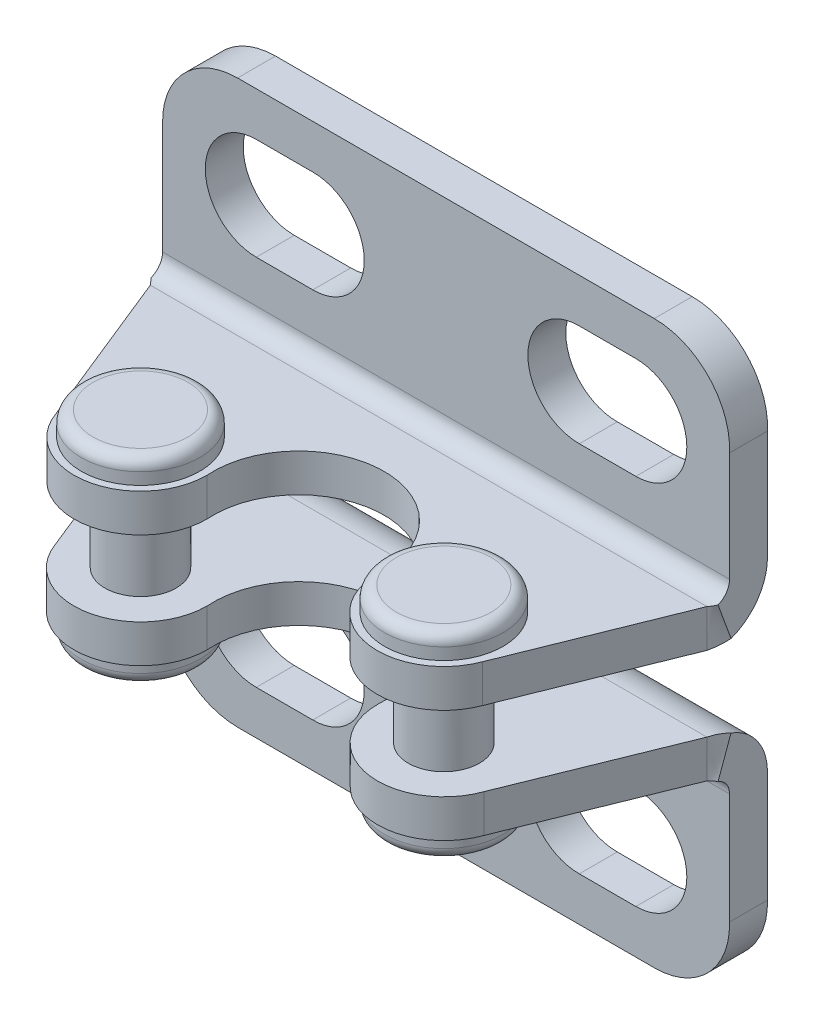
ISO-10303-21;
HEADER;
FILE_DESCRIPTION(('STEP AP214'),'2;1');
FILE_NAME('part.step','',(''),(''),'','','');
FILE_SCHEMA(('AUTOMOTIVE_DESIGN { 1 0 10303 214 1 1 1 1 }'));
ENDSEC;
DATA;
#1=APPLICATION_CONTEXT('core data for automotive mechanical design processes');
#2=APPLICATION_PROTOCOL_DEFINITION('international standard','automotive_design',2000,#1);
#3=PRODUCT_CONTEXT('',#1,'mechanical');
#4=PRODUCT('Part','Part','',(#3));
#5=PRODUCT_RELATED_PRODUCT_CATEGORY('part','',(#4));
#6=PRODUCT_DEFINITION_FORMATION('','',#4);
#7=PRODUCT_DEFINITION_CONTEXT('part definition',#1,'design');
#8=PRODUCT_DEFINITION('design','',#6,#7);
#9=PRODUCT_DEFINITION_SHAPE('','',#8);
#10=(LENGTH_UNIT() NAMED_UNIT(*) SI_UNIT(.MILLI.,.METRE.));
#11=(NAMED_UNIT(*) PLANE_ANGLE_UNIT() SI_UNIT($,.RADIAN.));
#12=(NAMED_UNIT(*) SI_UNIT($,.STERADIAN.) SOLID_ANGLE_UNIT());
#13=UNCERTAINTY_MEASURE_WITH_UNIT(LENGTH_MEASURE(1.E-05),#10,'distance_accuracy_value','');
#14=(GEOMETRIC_REPRESENTATION_CONTEXT(3) GLOBAL_UNCERTAINTY_ASSIGNED_CONTEXT((#13)) GLOBAL_UNIT_ASSIGNED_CONTEXT((#10,
#11,#12)) REPRESENTATION_CONTEXT('',''));
#15=CARTESIAN_POINT('',(0.,0.,0.));
#16=DIRECTION('',(0.,0.,1.));
#17=DIRECTION('',(1.,0.,0.));
#18=AXIS2_PLACEMENT_3D('',#15,#16,#17);
#19=CARTESIAN_POINT('',(14.3937500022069,4.63440597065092,8.08724678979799));
#20=DIRECTION('',(0.,1.,0.));
#21=DIRECTION('',(-0.71481216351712,0.,0.699316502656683));
#22=AXIS2_PLACEMENT_3D('',#19,#20,#21);
#23=CYLINDRICAL_SURFACE('',#22,1.5);
#24=CARTESIAN_POINT('',(14.3937500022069,9.43440597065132,8.08724678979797));
#25=DIRECTION('',(0.,1.,0.));
#26=DIRECTION('',(0.,0.,1.));
#27=AXIS2_PLACEMENT_3D('',#24,#25,#26);
#28=CIRCLE('',#27,1.5);
#29=CARTESIAN_POINT('',(14.3937500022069,9.43440597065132,9.58724678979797));
#30=VERTEX_POINT('',#29);
#31=EDGE_CURVE('E1268',#30,#30,#28,.F.);
#32=ORIENTED_EDGE('',*,*,#31,.T.);
#33=EDGE_LOOP('',(#32));
#34=FACE_BOUND('',#33,.T.);
#35=CARTESIAN_POINT('',(14.3937500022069,6.26975718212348,8.08724678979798));
#36=DIRECTION('',(0.,-1.,0.));
#37=DIRECTION('',(0.,0.,-1.));
#38=AXIS2_PLACEMENT_3D('',#35,#36,#37);
#39=CIRCLE('',#38,1.5);
#40=CARTESIAN_POINT('',(14.3937500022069,6.26975718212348,6.58724678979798));
#41=VERTEX_POINT('',#40);
#42=EDGE_CURVE('E457',#41,#41,#39,.F.);
#43=ORIENTED_EDGE('',*,*,#42,.T.);
#44=EDGE_LOOP('',(#43));
#45=FACE_BOUND('',#44,.T.);
#46=ADVANCED_FACE('F14',(#34,#45),#23,.T.);
#47=CARTESIAN_POINT('',(14.3937500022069,11.5344059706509,8.08724678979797));
#48=DIRECTION('',(0.,-1.,0.));
#49=DIRECTION('',(0.71481216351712,0.,-0.699316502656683));
#50=AXIS2_PLACEMENT_3D('',#47,#48,#49);
#51=TOROIDAL_SURFACE('',#50,2.,0.5);
#52=CARTESIAN_POINT('',(14.3937500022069,11.5344059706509,8.08724678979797));
#53=DIRECTION('',(0.,-1.,0.));
#54=DIRECTION('',(0.71481216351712,0.,-0.699316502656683));
#55=AXIS2_PLACEMENT_3D('',#52,#53,#54);
#56=CIRCLE('',#55,2.5);
#57=CARTESIAN_POINT('',(16.1807804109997,11.5344059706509,6.33895553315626));
#58=VERTEX_POINT('',#57);
#59=EDGE_CURVE('E1270',#58,#58,#56,.T.);
#60=ORIENTED_EDGE('',*,*,#59,.F.);
#61=EDGE_LOOP('',(#60));
#62=FACE_BOUND('',#61,.T.);
#63=CARTESIAN_POINT('',(14.3937500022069,12.0344059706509,8.08724678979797));
#64=DIRECTION('',(0.,1.,0.));
#65=DIRECTION('',(0.71481216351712,0.,-0.699316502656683));
#66=AXIS2_PLACEMENT_3D('',#63,#64,#65);
#67=CIRCLE('',#66,2.);
#68=CARTESIAN_POINT('',(15.8233743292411,12.0344059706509,6.6886137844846));
#69=VERTEX_POINT('',#68);
#70=EDGE_CURVE('E1199',#69,#69,#67,.T.);
#71=ORIENTED_EDGE('',*,*,#70,.F.);
#72=EDGE_LOOP('',(#71));
#73=FACE_BOUND('',#72,.T.);
#74=ADVANCED_FACE('F474',(#62,#73),#51,.T.);
#75=CARTESIAN_POINT('',(14.3937500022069,11.0344059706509,8.08724678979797));
#76=DIRECTION('',(0.,1.,0.));
#77=DIRECTION('',(-0.71481216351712,0.,0.699316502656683));
#78=AXIS2_PLACEMENT_3D('',#75,#76,#77);
#79=CYLINDRICAL_SURFACE('',#78,2.5);
#80=ORIENTED_EDGE('',*,*,#59,.T.);
#81=EDGE_LOOP('',(#80));
#82=FACE_BOUND('',#81,.T.);
#83=CARTESIAN_POINT('',(14.3937500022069,11.0344059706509,8.08724678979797));
#84=DIRECTION('',(0.,-1.,0.));
#85=DIRECTION('',(0.71481216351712,0.,-0.699316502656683));
#86=AXIS2_PLACEMENT_3D('',#83,#84,#85);
#87=CIRCLE('',#86,2.5);
#88=CARTESIAN_POINT('',(16.1807804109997,11.0344059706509,6.33895553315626));
#89=VERTEX_POINT('',#88);
#90=EDGE_CURVE('E1271',#89,#89,#87,.T.);
#91=ORIENTED_EDGE('',*,*,#90,.F.);
#92=EDGE_LOOP('',(#91));
#93=FACE_BOUND('',#92,.T.);
#94=ADVANCED_FACE('F481',(#82,#93),#79,.T.);
#95=CARTESIAN_POINT('',(14.3937500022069,12.0344059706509,8.08724678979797));
#96=DIRECTION('',(0.,-1.,0.));
#97=DIRECTION('',(0.71481216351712,0.,-0.699316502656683));
#98=AXIS2_PLACEMENT_3D('',#95,#96,#97);
#99=PLANE('',#98);
#100=ORIENTED_EDGE('',*,*,#70,.T.);
#101=EDGE_LOOP('',(#100));
#102=FACE_BOUND('',#101,.T.);
#103=ADVANCED_FACE('F490',(#102),#99,.F.);
#104=CARTESIAN_POINT('',(1.60625000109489,3.66975718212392,8.08724678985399));
#105=DIRECTION('',(0.,-1.,0.));
#106=DIRECTION('',(0.999794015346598,0.,-0.020295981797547));
#107=AXIS2_PLACEMENT_3D('',#104,#105,#106);
#108=PLANE('',#107);
#109=CARTESIAN_POINT('',(1.60625000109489,3.66975718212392,8.08724678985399));
#110=DIRECTION('',(0.,-1.,0.));
#111=DIRECTION('',(0.999794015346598,0.,-0.020295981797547));
#112=AXIS2_PLACEMENT_3D('',#109,#110,#111);
#113=CIRCLE('',#112,2.);
#114=CARTESIAN_POINT('',(3.60583803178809,3.66975718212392,8.04665482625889));
#115=VERTEX_POINT('',#114);
#116=EDGE_CURVE('E1231',#115,#115,#113,.T.);
#117=ORIENTED_EDGE('',*,*,#116,.T.);
#118=EDGE_LOOP('',(#117));
#119=FACE_BOUND('',#118,.T.);
#120=ADVANCED_FACE('F477',(#119),#108,.T.);
#121=CARTESIAN_POINT('',(16.,0.,0.));
#122=DIRECTION('',(0.,0.,1.));
#123=DIRECTION('',(0.,-1.,0.));
#124=AXIS2_PLACEMENT_3D('',#121,#122,#123);
#125=CYLINDRICAL_SURFACE('',#124,2.15);
#126=CARTESIAN_POINT('',(16.,0.,1.6));
#127=DIRECTION('',(0.,0.,1.));
#128=DIRECTION('',(0.,-1.,0.));
#129=AXIS2_PLACEMENT_3D('',#126,#127,#128);
#130=CIRCLE('',#129,2.15);
#131=CARTESIAN_POINT('',(16.,-2.15,1.6));
#132=VERTEX_POINT('',#131);
#133=CARTESIAN_POINT('',(16.,2.15,1.6));
#134=VERTEX_POINT('',#133);
#135=EDGE_CURVE('E755',#132,#134,#130,.T.);
#136=ORIENTED_EDGE('',*,*,#135,.T.);
#137=DIRECTION('',(0.,0.,1.));
#138=VECTOR('',#137,1.);
#139=CARTESIAN_POINT('',(16.,2.15,0.));
#140=LINE('',#139,#138);
#141=CARTESIAN_POINT('',(16.,2.15,0.));
#142=VERTEX_POINT('',#141);
#143=EDGE_CURVE('E312',#142,#134,#140,.T.);
#144=ORIENTED_EDGE('',*,*,#143,.F.);
#145=CARTESIAN_POINT('',(16.,0.,0.));
#146=DIRECTION('',(0.,0.,1.));
#147=DIRECTION('',(0.,-1.,0.));
#148=AXIS2_PLACEMENT_3D('',#145,#146,#147);
#149=CIRCLE('',#148,2.15);
#150=CARTESIAN_POINT('',(16.,-2.15,0.));
#151=VERTEX_POINT('',#150);
#152=EDGE_CURVE('E758',#151,#142,#149,.T.);
#153=ORIENTED_EDGE('',*,*,#152,.F.);
#154=DIRECTION('',(0.,0.,1.));
#155=VECTOR('',#154,1.);
#156=CARTESIAN_POINT('',(16.,-2.15,0.));
#157=LINE('',#156,#155);
#158=EDGE_CURVE('E789',#151,#132,#157,.T.);
#159=ORIENTED_EDGE('',*,*,#158,.T.);
#160=EDGE_LOOP('',(#136,#144,#153,#159));
#161=FACE_BOUND('',#160,.T.);
#162=ADVANCED_FACE('F427',(#161),#125,.F.);
#163=CARTESIAN_POINT('',(13.6187500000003,-2.15,0.));
#164=DIRECTION('',(0.,-1.,0.));
#165=DIRECTION('',(1.,0.,0.));
#166=AXIS2_PLACEMENT_3D('',#163,#164,#165);
#167=PLANE('',#166);
#168=DIRECTION('',(1.,0.,0.));
#169=VECTOR('',#168,1.);
#170=CARTESIAN_POINT('',(13.6187500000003,-2.15,1.6));
#171=LINE('',#170,#169);
#172=CARTESIAN_POINT('',(13.6187500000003,-2.15,1.6));
#173=VERTEX_POINT('',#172);
#174=EDGE_CURVE('E701',#173,#132,#171,.T.);
#175=ORIENTED_EDGE('',*,*,#174,.T.);
#176=ORIENTED_EDGE('',*,*,#158,.F.);
#177=DIRECTION('',(1.,0.,0.));
#178=VECTOR('',#177,1.);
#179=CARTESIAN_POINT('',(13.6187500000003,-2.15,0.));
#180=LINE('',#179,#178);
#181=CARTESIAN_POINT('',(13.6187500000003,-2.15,0.));
#182=VERTEX_POINT('',#181);
#183=EDGE_CURVE('E782',#182,#151,#180,.T.);
#184=ORIENTED_EDGE('',*,*,#183,.F.);
#185=DIRECTION('',(0.,0.,1.));
#186=VECTOR('',#185,1.);
#187=CARTESIAN_POINT('',(13.6187500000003,-2.15,0.));
#188=LINE('',#187,#186);
#189=EDGE_CURVE('E693',#182,#173,#188,.T.);
#190=ORIENTED_EDGE('',*,*,#189,.T.);
#191=EDGE_LOOP('',(#175,#176,#184,#190));
#192=FACE_BOUND('',#191,.T.);
#193=ADVANCED_FACE('F358',(#192),#167,.F.);
#194=CARTESIAN_POINT('',(13.6000810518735,2.4980018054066E-13,0.));
#195=DIRECTION('',(0.,0.,1.));
#196=DIRECTION('',(0.,-1.,0.));
#197=AXIS2_PLACEMENT_3D('',#194,#195,#196);
#198=CYLINDRICAL_SURFACE('',#197,2.15008105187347);
#199=ORIENTED_EDGE('',*,*,#189,.F.);
#200=CARTESIAN_POINT('',(13.6000810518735,2.4980018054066E-13,0.));
#201=DIRECTION('',(0.,0.,1.));
#202=DIRECTION('',(0.,-1.,0.));
#203=AXIS2_PLACEMENT_3D('',#200,#201,#202);
#204=CIRCLE('',#203,2.15008105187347);
#205=CARTESIAN_POINT('',(13.6187500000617,2.15,0.));
#206=VERTEX_POINT('',#205);
#207=EDGE_CURVE('E713',#206,#182,#204,.T.);
#208=ORIENTED_EDGE('',*,*,#207,.F.);
#209=DIRECTION('',(0.,0.,1.));
#210=VECTOR('',#209,1.);
#211=CARTESIAN_POINT('',(13.6187500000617,2.15,0.));
#212=LINE('',#211,#210);
#213=CARTESIAN_POINT('',(13.6187500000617,2.15,1.6));
#214=VERTEX_POINT('',#213);
#215=EDGE_CURVE('E689',#206,#214,#212,.T.);
#216=ORIENTED_EDGE('',*,*,#215,.T.);
#217=CARTESIAN_POINT('',(13.6000810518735,2.53269627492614E-13,1.6));
#218=DIRECTION('',(0.,0.,1.));
#219=DIRECTION('',(0.,-1.,0.));
#220=AXIS2_PLACEMENT_3D('',#217,#218,#219);
#221=CIRCLE('',#220,2.15008105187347);
#222=EDGE_CURVE('E740',#214,#173,#221,.T.);
#223=ORIENTED_EDGE('',*,*,#222,.T.);
#224=EDGE_LOOP('',(#199,#208,#216,#223));
#225=FACE_BOUND('',#224,.T.);
#226=ADVANCED_FACE('F821',(#225),#198,.F.);
#227=CARTESIAN_POINT('',(16.,2.15,0.));
#228=DIRECTION('',(0.,1.,0.));
#229=DIRECTION('',(0.,0.,-1.));
#230=AXIS2_PLACEMENT_3D('',#227,#228,#229);
#231=PLANE('',#230);
#232=DIRECTION('',(-1.,0.,0.));
#233=VECTOR('',#232,1.);
#234=CARTESIAN_POINT('',(16.,2.15,1.6));
#235=LINE('',#234,#233);
#236=EDGE_CURVE('E682',#134,#214,#235,.T.);
#237=ORIENTED_EDGE('',*,*,#236,.T.);
#238=ORIENTED_EDGE('',*,*,#215,.F.);
#239=DIRECTION('',(-1.,0.,0.));
#240=VECTOR('',#239,1.);
#241=CARTESIAN_POINT('',(16.,2.15,0.));
#242=LINE('',#241,#240);
#243=EDGE_CURVE('E709',#142,#206,#242,.T.);
#244=ORIENTED_EDGE('',*,*,#243,.F.);
#245=ORIENTED_EDGE('',*,*,#143,.T.);
#246=EDGE_LOOP('',(#237,#238,#244,#245));
#247=FACE_BOUND('',#246,.T.);
#248=ADVANCED_FACE('F830',(#247),#231,.F.);
#249=CARTESIAN_POINT('',(0.,0.,0.));
#250=DIRECTION('',(0.,0.,1.));
#251=DIRECTION('',(0.,-1.,0.));
#252=AXIS2_PLACEMENT_3D('',#249,#250,#251);
#253=CYLINDRICAL_SURFACE('',#252,2.15);
#254=CARTESIAN_POINT('',(0.,0.,1.6));
#255=DIRECTION('',(0.,0.,1.));
#256=DIRECTION('',(0.,-1.,0.));
#257=AXIS2_PLACEMENT_3D('',#254,#255,#256);
#258=CIRCLE('',#257,2.15);
#259=CARTESIAN_POINT('',(0.,2.15,1.6));
#260=VERTEX_POINT('',#259);
#261=CARTESIAN_POINT('',(0.,-2.15,1.6));
#262=VERTEX_POINT('',#261);
#263=EDGE_CURVE('E296',#260,#262,#258,.T.);
#264=ORIENTED_EDGE('',*,*,#263,.T.);
#265=DIRECTION('',(0.,0.,1.));
#266=VECTOR('',#265,1.);
#267=CARTESIAN_POINT('',(0.,-2.15,0.));
#268=LINE('',#267,#266);
#269=CARTESIAN_POINT('',(0.,-2.15,0.));
#270=VERTEX_POINT('',#269);
#271=EDGE_CURVE('E727',#270,#262,#268,.T.);
#272=ORIENTED_EDGE('',*,*,#271,.F.);
#273=CARTESIAN_POINT('',(0.,0.,0.));
#274=DIRECTION('',(0.,0.,1.));
#275=DIRECTION('',(0.,-1.,0.));
#276=AXIS2_PLACEMENT_3D('',#273,#274,#275);
#277=CIRCLE('',#276,2.15);
#278=CARTESIAN_POINT('',(0.,2.15,0.));
#279=VERTEX_POINT('',#278);
#280=EDGE_CURVE('E298',#279,#270,#277,.T.);
#281=ORIENTED_EDGE('',*,*,#280,.F.);
#282=DIRECTION('',(0.,0.,1.));
#283=VECTOR('',#282,1.);
#284=CARTESIAN_POINT('',(0.,2.15,0.));
#285=LINE('',#284,#283);
#286=EDGE_CURVE('E292',#279,#260,#285,.T.);
#287=ORIENTED_EDGE('',*,*,#286,.T.);
#288=EDGE_LOOP('',(#264,#272,#281,#287));
#289=FACE_BOUND('',#288,.T.);
#290=ADVANCED_FACE('F294',(#289),#253,.F.);
#291=CARTESIAN_POINT('',(0.,2.15,0.));
#292=DIRECTION('',(0.,1.,0.));
#293=DIRECTION('',(0.,0.,-1.));
#294=AXIS2_PLACEMENT_3D('',#291,#292,#293);
#295=PLANE('',#294);
#296=DIRECTION('',(-1.,0.,0.));
#297=VECTOR('',#296,1.);
#298=CARTESIAN_POINT('',(0.,2.15,1.6));
#299=LINE('',#298,#297);
#300=CARTESIAN_POINT('',(2.38125,2.15,1.6));
#301=VERTEX_POINT('',#300);
#302=EDGE_CURVE('E304',#301,#260,#299,.T.);
#303=ORIENTED_EDGE('',*,*,#302,.T.);
#304=ORIENTED_EDGE('',*,*,#286,.F.);
#305=DIRECTION('',(-1.,0.,0.));
#306=VECTOR('',#305,1.);
#307=CARTESIAN_POINT('',(0.,2.15,0.));
#308=LINE('',#307,#306);
#309=CARTESIAN_POINT('',(2.38125,2.15,0.));
#310=VERTEX_POINT('',#309);
#311=EDGE_CURVE('E736',#310,#279,#308,.T.);
#312=ORIENTED_EDGE('',*,*,#311,.F.);
#313=DIRECTION('',(0.,0.,1.));
#314=VECTOR('',#313,1.);
#315=CARTESIAN_POINT('',(2.38125,2.15,0.));
#316=LINE('',#315,#314);
#317=EDGE_CURVE('E316',#310,#301,#316,.T.);
#318=ORIENTED_EDGE('',*,*,#317,.T.);
#319=EDGE_LOOP('',(#303,#304,#312,#318));
#320=FACE_BOUND('',#319,.T.);
#321=ADVANCED_FACE('F314',(#320),#295,.F.);
#322=CARTESIAN_POINT('',(2.3999189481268,0.,0.));
#323=DIRECTION('',(0.,0.,1.));
#324=DIRECTION('',(0.,-1.,0.));
#325=AXIS2_PLACEMENT_3D('',#322,#323,#324);
#326=CYLINDRICAL_SURFACE('',#325,2.1500810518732);
#327=DIRECTION('',(0.,0.,1.));
#328=VECTOR('',#327,1.);
#329=CARTESIAN_POINT('',(2.38125,-2.15,0.));
#330=LINE('',#329,#328);
#331=CARTESIAN_POINT('',(2.38125,-2.15,0.));
#332=VERTEX_POINT('',#331);
#333=CARTESIAN_POINT('',(2.38125,-2.15,1.6));
#334=VERTEX_POINT('',#333);
#335=EDGE_CURVE('E322',#332,#334,#330,.T.);
#336=ORIENTED_EDGE('',*,*,#335,.T.);
#337=CARTESIAN_POINT('',(2.3999189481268,0.,1.6));
#338=DIRECTION('',(0.,0.,1.));
#339=DIRECTION('',(0.,-1.,0.));
#340=AXIS2_PLACEMENT_3D('',#337,#338,#339);
#341=CIRCLE('',#340,2.1500810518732);
#342=EDGE_CURVE('E743',#334,#301,#341,.T.);
#343=ORIENTED_EDGE('',*,*,#342,.T.);
#344=ORIENTED_EDGE('',*,*,#317,.F.);
#345=CARTESIAN_POINT('',(2.3999189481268,0.,0.));
#346=DIRECTION('',(0.,0.,1.));
#347=DIRECTION('',(0.,-1.,0.));
#348=AXIS2_PLACEMENT_3D('',#345,#346,#347);
#349=CIRCLE('',#348,2.1500810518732);
#350=EDGE_CURVE('E726',#332,#310,#349,.T.);
#351=ORIENTED_EDGE('',*,*,#350,.F.);
#352=EDGE_LOOP('',(#336,#343,#344,#351));
#353=FACE_BOUND('',#352,.T.);
#354=ADVANCED_FACE('F1430',(#353),#326,.F.);
#355=CARTESIAN_POINT('',(2.38125,-2.15,0.));
#356=DIRECTION('',(0.,-1.,0.));
#357=DIRECTION('',(1.,0.,0.));
#358=AXIS2_PLACEMENT_3D('',#355,#356,#357);
#359=PLANE('',#358);
#360=DIRECTION('',(1.,0.,0.));
#361=VECTOR('',#360,1.);
#362=CARTESIAN_POINT('',(2.38125,-2.15,1.6));
#363=LINE('',#362,#361);
#364=EDGE_CURVE('E310',#262,#334,#363,.T.);
#365=ORIENTED_EDGE('',*,*,#364,.T.);
#366=ORIENTED_EDGE('',*,*,#335,.F.);
#367=DIRECTION('',(1.,0.,0.));
#368=VECTOR('',#367,1.);
#369=CARTESIAN_POINT('',(2.38125,-2.15,0.));
#370=LINE('',#369,#368);
#371=EDGE_CURVE('E721',#270,#332,#370,.T.);
#372=ORIENTED_EDGE('',*,*,#371,.F.);
#373=ORIENTED_EDGE('',*,*,#271,.T.);
#374=EDGE_LOOP('',(#365,#366,#372,#373));
#375=FACE_BOUND('',#374,.T.);
#376=ADVANCED_FACE('F356',(#375),#359,.F.);
#377=CARTESIAN_POINT('',(-0.778454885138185,-0.825000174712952,0.));
#378=DIRECTION('',(0.,0.,1.));
#379=DIRECTION('',(0.,-1.,0.));
#380=AXIS2_PLACEMENT_3D('',#377,#378,#379);
#381=CYLINDRICAL_SURFACE('',#380,3.175);
#382=DIRECTION('',(0.,0.,1.));
#383=VECTOR('',#382,1.);
#384=CARTESIAN_POINT('',(-0.777401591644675,-4.,0.));
#385=LINE('',#384,#383);
#386=CARTESIAN_POINT('',(-0.777401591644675,-4.,0.));
#387=VERTEX_POINT('',#386);
#388=CARTESIAN_POINT('',(-0.777401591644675,-4.,1.6));
#389=VERTEX_POINT('',#388);
#390=EDGE_CURVE('E683',#387,#389,#385,.T.);
#391=ORIENTED_EDGE('',*,*,#390,.T.);
#392=CARTESIAN_POINT('',(-0.778454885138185,-0.825000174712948,1.6));
#393=DIRECTION('',(0.,0.,1.));
#394=DIRECTION('',(0.,-1.,0.));
#395=AXIS2_PLACEMENT_3D('',#392,#393,#394);
#396=CIRCLE('',#395,3.175);
#397=CARTESIAN_POINT('',(-3.95,-0.676923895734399,1.6));
#398=VERTEX_POINT('',#397);
#399=EDGE_CURVE('E670',#398,#389,#396,.T.);
#400=ORIENTED_EDGE('',*,*,#399,.F.);
#401=DIRECTION('',(0.,0.,1.));
#402=VECTOR('',#401,1.);
#403=CARTESIAN_POINT('',(-3.95,-0.676923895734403,0.));
#404=LINE('',#403,#402);
#405=CARTESIAN_POINT('',(-3.95,-0.676923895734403,0.));
#406=VERTEX_POINT('',#405);
#407=EDGE_CURVE('E331',#406,#398,#404,.T.);
#408=ORIENTED_EDGE('',*,*,#407,.F.);
#409=CARTESIAN_POINT('',(-0.778454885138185,-0.825000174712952,0.));
#410=DIRECTION('',(0.,0.,1.));
#411=DIRECTION('',(0.,-1.,0.));
#412=AXIS2_PLACEMENT_3D('',#409,#410,#411);
#413=CIRCLE('',#412,3.175);
#414=EDGE_CURVE('E705',#406,#387,#413,.T.);
#415=ORIENTED_EDGE('',*,*,#414,.T.);
#416=EDGE_LOOP('',(#391,#400,#408,#415));
#417=FACE_BOUND('',#416,.T.);
#418=ADVANCED_FACE('F1379',(#417),#381,.T.);
#419=CARTESIAN_POINT('',(-0.777401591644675,-4.,0.));
#420=DIRECTION('',(0.,-1.,0.));
#421=DIRECTION('',(1.,0.,0.));
#422=AXIS2_PLACEMENT_3D('',#419,#420,#421);
#423=PLANE('',#422);
#424=DIRECTION('',(1.,0.,0.));
#425=VECTOR('',#424,1.);
#426=CARTESIAN_POINT('',(-0.777401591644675,-4.,1.6));
#427=LINE('',#426,#425);
#428=CARTESIAN_POINT('',(16.7886967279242,-4.,1.6));
#429=VERTEX_POINT('',#428);
#430=EDGE_CURVE('E679',#389,#429,#427,.T.);
#431=ORIENTED_EDGE('',*,*,#430,.F.);
#432=ORIENTED_EDGE('',*,*,#390,.F.);
#433=DIRECTION('',(1.,0.,0.));
#434=VECTOR('',#433,1.);
#435=CARTESIAN_POINT('',(-0.777401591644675,-4.,0.));
#436=LINE('',#435,#434);
#437=CARTESIAN_POINT('',(16.7886967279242,-4.,0.));
#438=VERTEX_POINT('',#437);
#439=EDGE_CURVE('E688',#387,#438,#436,.T.);
#440=ORIENTED_EDGE('',*,*,#439,.T.);
#441=DIRECTION('',(0.,0.,1.));
#442=VECTOR('',#441,1.);
#443=CARTESIAN_POINT('',(16.7886967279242,-4.,0.));
#444=LINE('',#443,#442);
#445=EDGE_CURVE('E744',#438,#429,#444,.T.);
#446=ORIENTED_EDGE('',*,*,#445,.T.);
#447=EDGE_LOOP('',(#431,#432,#440,#446));
#448=FACE_BOUND('',#447,.T.);
#449=ADVANCED_FACE('F1382',(#448),#423,.T.);
#450=CARTESIAN_POINT('',(16.7760714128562,-0.825025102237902,0.));
#451=DIRECTION('',(0.,0.,1.));
#452=DIRECTION('',(0.,-1.,0.));
#453=AXIS2_PLACEMENT_3D('',#450,#451,#452);
#454=CYLINDRICAL_SURFACE('',#453,3.175);
#455=CARTESIAN_POINT('',(16.7760714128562,-0.825025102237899,1.6));
#456=DIRECTION('',(0.,0.,1.));
#457=DIRECTION('',(0.,-1.,0.));
#458=AXIS2_PLACEMENT_3D('',#455,#456,#457);
#459=CIRCLE('',#458,3.175);
#460=CARTESIAN_POINT('',(19.95,-0.742548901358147,1.6));
#461=VERTEX_POINT('',#460);
#462=EDGE_CURVE('E785',#429,#461,#459,.T.);
#463=ORIENTED_EDGE('',*,*,#462,.F.);
#464=ORIENTED_EDGE('',*,*,#445,.F.);
#465=CARTESIAN_POINT('',(16.7760714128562,-0.825025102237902,0.));
#466=DIRECTION('',(0.,0.,1.));
#467=DIRECTION('',(0.,-1.,0.));
#468=AXIS2_PLACEMENT_3D('',#465,#466,#467);
#469=CIRCLE('',#468,3.175);
#470=CARTESIAN_POINT('',(19.95,-0.74254890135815,0.));
#471=VERTEX_POINT('',#470);
#472=EDGE_CURVE('E748',#438,#471,#469,.T.);
#473=ORIENTED_EDGE('',*,*,#472,.T.);
#474=DIRECTION('',(0.,0.,1.));
#475=VECTOR('',#474,1.);
#476=CARTESIAN_POINT('',(19.95,-0.74254890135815,0.));
#477=LINE('',#476,#475);
#478=EDGE_CURVE('E751',#471,#461,#477,.T.);
#479=ORIENTED_EDGE('',*,*,#478,.T.);
#480=EDGE_LOOP('',(#463,#464,#473,#479));
#481=FACE_BOUND('',#480,.T.);
#482=ADVANCED_FACE('F1422',(#481),#454,.T.);
#483=CARTESIAN_POINT('',(19.95,-0.74254890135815,0.));
#484=DIRECTION('',(1.,0.,0.));
#485=DIRECTION('',(0.,0.,1.));
#486=AXIS2_PLACEMENT_3D('',#483,#484,#485);
#487=PLANE('',#486);
#488=DIRECTION('',(0.,1.,0.));
#489=VECTOR('',#488,1.);
#490=CARTESIAN_POINT('',(19.95,-0.74254890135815,0.));
#491=LINE('',#490,#489);
#492=CARTESIAN_POINT('',(19.95,3.93315718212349,0.));
#493=VERTEX_POINT('',#492);
#494=EDGE_CURVE('E669',#471,#493,#491,.T.);
#495=ORIENTED_EDGE('',*,*,#494,.T.);
#496=CARTESIAN_POINT('',(19.95,3.93315718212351,2.3366));
#497=DIRECTION('',(-1.,0.,0.));
#498=DIRECTION('',(0.,1.,0.));
#499=AXIS2_PLACEMENT_3D('',#496,#497,#498);
#500=CIRCLE('',#499,2.3366);
#501=CARTESIAN_POINT('',(19.95,6.1284773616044,1.53643197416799));
#502=VERTEX_POINT('',#501);
#503=EDGE_CURVE('E438',#502,#493,#500,.T.);
#504=ORIENTED_EDGE('',*,*,#503,.F.);
#505=CARTESIAN_POINT('',(19.95,4.62521951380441,2.08435153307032));
#506=CARTESIAN_POINT('',(19.95,6.1284773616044,1.53643197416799));
#507=(BOUNDED_CURVE() B_SPLINE_CURVE(1,(#505,#506),.UNSPECIFIED.,.F.,
.F.) B_SPLINE_CURVE_WITH_KNOTS((2,2),(0.,1.),
.UNSPECIFIED.) CURVE() GEOMETRIC_REPRESENTATION_ITEM() RATIONAL_B_SPLINE_CURVE((1.,1.)) REPRESENTATION_ITEM(''));
#508=CARTESIAN_POINT('',(19.95,4.62521951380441,2.08435153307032));
#509=VERTEX_POINT('',#508);
#510=EDGE_CURVE('E367',#509,#502,#507,.T.);
#511=ORIENTED_EDGE('',*,*,#510,.F.);
#512=CARTESIAN_POINT('',(19.95,3.93315718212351,2.3366));
#513=DIRECTION('',(-1.,0.,0.));
#514=DIRECTION('',(0.,1.,0.));
#515=AXIS2_PLACEMENT_3D('',#512,#513,#514);
#516=CIRCLE('',#515,0.7366);
#517=CARTESIAN_POINT('',(19.95,3.9331571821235,1.6));
#518=VERTEX_POINT('',#517);
#519=EDGE_CURVE('E397',#509,#518,#516,.T.);
#520=ORIENTED_EDGE('',*,*,#519,.T.);
#521=DIRECTION('',(0.,1.,0.));
#522=VECTOR('',#521,1.);
#523=CARTESIAN_POINT('',(19.95,-0.742548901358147,1.6));
#524=LINE('',#523,#522);
#525=EDGE_CURVE('E330',#461,#518,#524,.T.);
#526=ORIENTED_EDGE('',*,*,#525,.F.);
#527=ORIENTED_EDGE('',*,*,#478,.F.);
#528=EDGE_LOOP('',(#495,#504,#511,#520,#526,#527));
#529=FACE_BOUND('',#528,.T.);
#530=ADVANCED_FACE('F1389',(#529),#487,.T.);
#531=CARTESIAN_POINT('',(-3.95,5.8097657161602,0.));
#532=DIRECTION('',(-1.,0.,0.));
#533=DIRECTION('',(0.,-1.,0.));
#534=AXIS2_PLACEMENT_3D('',#531,#532,#533);
#535=PLANE('',#534);
#536=DIRECTION('',(0.,-1.,0.));
#537=VECTOR('',#536,1.);
#538=CARTESIAN_POINT('',(-3.95,5.8097657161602,1.6));
#539=LINE('',#538,#537);
#540=CARTESIAN_POINT('',(-3.95,3.9331571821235,1.6));
#541=VERTEX_POINT('',#540);
#542=EDGE_CURVE('E665',#541,#398,#539,.T.);
#543=ORIENTED_EDGE('',*,*,#542,.F.);
#544=CARTESIAN_POINT('',(-3.95,3.93315718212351,2.3366));
#545=DIRECTION('',(1.,0.,0.));
#546=DIRECTION('',(0.,1.,0.));
#547=AXIS2_PLACEMENT_3D('',#544,#545,#546);
#548=CIRCLE('',#547,0.7366);
#549=CARTESIAN_POINT('',(-3.95,4.62521951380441,2.08435153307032));
#550=VERTEX_POINT('',#549);
#551=EDGE_CURVE('E404',#541,#550,#548,.T.);
#552=ORIENTED_EDGE('',*,*,#551,.T.);
#553=CARTESIAN_POINT('',(-3.95,4.62521951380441,2.08435153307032));
#554=CARTESIAN_POINT('',(-3.95,5.12630546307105,1.90171168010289));
#555=CARTESIAN_POINT('',(-3.95,5.62739141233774,1.71907182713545));
#556=CARTESIAN_POINT('',(-3.95,6.1284773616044,1.53643197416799));
#557=(BOUNDED_CURVE() B_SPLINE_CURVE(3,(#553,#554,#555,#556),.UNSPECIFIED.,.F.,
.F.) B_SPLINE_CURVE_WITH_KNOTS((4,4),(0.,1.),
.UNSPECIFIED.) CURVE() GEOMETRIC_REPRESENTATION_ITEM() RATIONAL_B_SPLINE_CURVE((1.,1.,1.,1.)) REPRESENTATION_ITEM(''));
#558=CARTESIAN_POINT('',(-3.95,6.1284773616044,1.53643197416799));
#559=VERTEX_POINT('',#558);
#560=EDGE_CURVE('E339',#550,#559,#557,.T.);
#561=ORIENTED_EDGE('',*,*,#560,.T.);
#562=CARTESIAN_POINT('',(-3.95,3.93315718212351,2.3366));
#563=DIRECTION('',(1.,0.,0.));
#564=DIRECTION('',(0.,-1.,0.));
#565=AXIS2_PLACEMENT_3D('',#562,#563,#564);
#566=CIRCLE('',#565,2.3366);
#567=CARTESIAN_POINT('',(-3.95,3.93315718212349,0.));
#568=VERTEX_POINT('',#567);
#569=EDGE_CURVE('E411',#568,#559,#566,.T.);
#570=ORIENTED_EDGE('',*,*,#569,.F.);
#571=DIRECTION('',(0.,-1.,0.));
#572=VECTOR('',#571,1.);
#573=CARTESIAN_POINT('',(-3.95,5.8097657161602,0.));
#574=LINE('',#573,#572);
#575=EDGE_CURVE('E326',#568,#406,#574,.T.);
#576=ORIENTED_EDGE('',*,*,#575,.T.);
#577=ORIENTED_EDGE('',*,*,#407,.T.);
#578=EDGE_LOOP('',(#543,#552,#561,#570,#576,#577));
#579=FACE_BOUND('',#578,.T.);
#580=ADVANCED_FACE('F1315',(#579),#535,.T.);
#581=CARTESIAN_POINT('',(3.23187418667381E-09,15.7041631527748,6.91946500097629E-11));
#582=DIRECTION('',(8.686E-12,0.,1.));
#583=DIRECTION('',(0.,1.,0.));
#584=AXIS2_PLACEMENT_3D('',#581,#582,#583);
#585=CYLINDRICAL_SURFACE('',#584,2.15);
#586=CARTESIAN_POINT('',(3.24577018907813E-09,15.7041631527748,1.6000000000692));
#587=DIRECTION('',(8.686E-12,0.,1.));
#588=DIRECTION('',(0.,1.,0.));
#589=AXIS2_PLACEMENT_3D('',#586,#587,#588);
#590=CIRCLE('',#589,2.15);
#591=CARTESIAN_POINT('',(3.24579013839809E-09,17.8541631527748,1.60000000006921));
#592=VERTEX_POINT('',#591);
#593=CARTESIAN_POINT('',(3.24577018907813E-09,13.5541631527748,1.60000000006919));
#594=VERTEX_POINT('',#593);
#595=EDGE_CURVE('E991',#592,#594,#590,.T.);
#596=ORIENTED_EDGE('',*,*,#595,.T.);
#597=DIRECTION('',(8.686E-12,0.,1.));
#598=VECTOR('',#597,1.);
#599=CARTESIAN_POINT('',(3.23187418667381E-09,13.5541631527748,6.91903132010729E-11));
#600=LINE('',#599,#598);
#601=CARTESIAN_POINT('',(3.23187418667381E-09,13.5541631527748,6.91903132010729E-11));
#602=VERTEX_POINT('',#601);
#603=EDGE_CURVE('E1002',#602,#594,#600,.T.);
#604=ORIENTED_EDGE('',*,*,#603,.F.);
#605=CARTESIAN_POINT('',(3.23187418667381E-09,15.7041631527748,6.91946500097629E-11));
#606=DIRECTION('',(8.686E-12,0.,1.));
#607=DIRECTION('',(0.,1.,0.));
#608=AXIS2_PLACEMENT_3D('',#605,#606,#607);
#609=CIRCLE('',#608,2.15);
#610=CARTESIAN_POINT('',(3.23189413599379E-09,17.8541631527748,6.92085277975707E-11));
#611=VERTEX_POINT('',#610);
#612=EDGE_CURVE('E970',#611,#602,#609,.T.);
#613=ORIENTED_EDGE('',*,*,#612,.F.);
#614=DIRECTION('',(8.686E-12,0.,1.));
#615=VECTOR('',#614,1.);
#616=CARTESIAN_POINT('',(3.23189413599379E-09,17.8541631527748,6.92085277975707E-11));
#617=LINE('',#616,#615);
#618=EDGE_CURVE('E987',#611,#592,#617,.T.);
#619=ORIENTED_EDGE('',*,*,#618,.T.);
#620=EDGE_LOOP('',(#596,#604,#613,#619));
#621=FACE_BOUND('',#620,.T.);
#622=ADVANCED_FACE('F639',(#621),#585,.F.);
#623=CARTESIAN_POINT('',(2.38125000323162,17.8541631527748,4.85184808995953E-11));
#624=DIRECTION('',(0.,1.,0.));
#625=DIRECTION('',(-1.,0.,8.686E-12));
#626=AXIS2_PLACEMENT_3D('',#623,#624,#625);
#627=PLANE('',#626);
#628=DIRECTION('',(-1.,0.,8.686E-12));
#629=VECTOR('',#628,1.);
#630=CARTESIAN_POINT('',(2.38125000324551,17.8541631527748,1.60000000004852));
#631=LINE('',#630,#629);
#632=CARTESIAN_POINT('',(2.38125000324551,17.8541631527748,1.60000000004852));
#633=VERTEX_POINT('',#632);
#634=EDGE_CURVE('E992',#633,#592,#631,.T.);
#635=ORIENTED_EDGE('',*,*,#634,.T.);
#636=ORIENTED_EDGE('',*,*,#618,.F.);
#637=DIRECTION('',(-1.,0.,8.686E-12));
#638=VECTOR('',#637,1.);
#639=CARTESIAN_POINT('',(2.38125000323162,17.8541631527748,4.85184808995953E-11));
#640=LINE('',#639,#638);
#641=CARTESIAN_POINT('',(2.38125000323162,17.8541631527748,4.85184808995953E-11));
#642=VERTEX_POINT('',#641);
#643=EDGE_CURVE('E973',#642,#611,#640,.T.);
#644=ORIENTED_EDGE('',*,*,#643,.F.);
#645=DIRECTION('',(8.686E-12,0.,1.));
#646=VECTOR('',#645,1.);
#647=CARTESIAN_POINT('',(2.38125000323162,17.8541631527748,4.85184808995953E-11));
#648=LINE('',#647,#646);
#649=EDGE_CURVE('E1017',#642,#633,#648,.T.);
#650=ORIENTED_EDGE('',*,*,#649,.T.);
#651=EDGE_LOOP('',(#635,#636,#644,#650));
#652=FACE_BOUND('',#651,.T.);
#653=ADVANCED_FACE('F551',(#652),#627,.F.);
#654=CARTESIAN_POINT('',(2.39991895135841,15.7041631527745,4.83545495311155E-11));
#655=DIRECTION('',(8.686E-12,0.,1.));
#656=DIRECTION('',(0.,1.,0.));
#657=AXIS2_PLACEMENT_3D('',#654,#655,#656);
#658=CYLINDRICAL_SURFACE('',#657,2.15008105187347);
#659=ORIENTED_EDGE('',*,*,#649,.F.);
#660=CARTESIAN_POINT('',(2.39991895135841,15.7041631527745,4.83545495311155E-11));
#661=DIRECTION('',(8.686E-12,0.,1.));
#662=DIRECTION('',(0.,1.,0.));
#663=AXIS2_PLACEMENT_3D('',#660,#661,#662);
#664=CIRCLE('',#663,2.15008105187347);
#665=CARTESIAN_POINT('',(2.38125000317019,13.5541631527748,4.85002663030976E-11));
#666=VERTEX_POINT('',#665);
#667=EDGE_CURVE('E1021',#666,#642,#664,.T.);
#668=ORIENTED_EDGE('',*,*,#667,.F.);
#669=DIRECTION('',(8.686E-12,0.,1.));
#670=VECTOR('',#669,1.);
#671=CARTESIAN_POINT('',(2.38125000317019,13.5541631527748,4.85002663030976E-11));
#672=LINE('',#671,#670);
#673=CARTESIAN_POINT('',(2.38125000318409,13.5541631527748,1.6000000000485));
#674=VERTEX_POINT('',#673);
#675=EDGE_CURVE('E1191',#666,#674,#672,.T.);
#676=ORIENTED_EDGE('',*,*,#675,.T.);
#677=CARTESIAN_POINT('',(2.39991895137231,15.7041631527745,1.60000000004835));
#678=DIRECTION('',(8.686E-12,0.,1.));
#679=DIRECTION('',(0.,1.,0.));
#680=AXIS2_PLACEMENT_3D('',#677,#678,#679);
#681=CIRCLE('',#680,2.15008105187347);
#682=EDGE_CURVE('E963',#674,#633,#681,.T.);
#683=ORIENTED_EDGE('',*,*,#682,.T.);
#684=EDGE_LOOP('',(#659,#668,#676,#683));
#685=FACE_BOUND('',#684,.T.);
#686=ADVANCED_FACE('F548',(#685),#658,.F.);
#687=CARTESIAN_POINT('',(3.23187418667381E-09,13.5541631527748,6.91903132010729E-11));
#688=DIRECTION('',(0.,-1.,0.));
#689=DIRECTION('',(-8.686E-12,0.,-1.));
#690=AXIS2_PLACEMENT_3D('',#687,#688,#689);
#691=PLANE('',#690);
#692=DIRECTION('',(1.,0.,-8.686E-12));
#693=VECTOR('',#692,1.);
#694=CARTESIAN_POINT('',(3.24577018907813E-09,13.5541631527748,1.60000000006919));
#695=LINE('',#694,#693);
#696=EDGE_CURVE('E1195',#594,#674,#695,.T.);
#697=ORIENTED_EDGE('',*,*,#696,.T.);
#698=ORIENTED_EDGE('',*,*,#675,.F.);
#699=DIRECTION('',(1.,0.,-8.686E-12));
#700=VECTOR('',#699,1.);
#701=CARTESIAN_POINT('',(3.23187418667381E-09,13.5541631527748,6.91903132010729E-11));
#702=LINE('',#701,#700);
#703=EDGE_CURVE('E1032',#602,#666,#702,.T.);
#704=ORIENTED_EDGE('',*,*,#703,.F.);
#705=ORIENTED_EDGE('',*,*,#603,.T.);
#706=EDGE_LOOP('',(#697,#698,#704,#705));
#707=FACE_BOUND('',#706,.T.);
#708=ADVANCED_FACE('F529',(#707),#691,.F.);
#709=CARTESIAN_POINT('',(16.0000000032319,15.7041631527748,-6.97757823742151E-11));
#710=DIRECTION('',(8.686E-12,0.,1.));
#711=DIRECTION('',(0.,1.,0.));
#712=AXIS2_PLACEMENT_3D('',#709,#710,#711);
#713=CYLINDRICAL_SURFACE('',#712,2.15);
#714=CARTESIAN_POINT('',(16.0000000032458,15.7041631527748,1.59999999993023));
#715=DIRECTION('',(8.686E-12,0.,1.));
#716=DIRECTION('',(0.,1.,0.));
#717=AXIS2_PLACEMENT_3D('',#714,#715,#716);
#718=CIRCLE('',#717,2.15);
#719=CARTESIAN_POINT('',(16.0000000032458,13.5541631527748,1.59999999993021));
#720=VERTEX_POINT('',#719);
#721=CARTESIAN_POINT('',(16.0000000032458,17.8541631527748,1.59999999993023));
#722=VERTEX_POINT('',#721);
#723=EDGE_CURVE('E998',#720,#722,#718,.T.);
#724=ORIENTED_EDGE('',*,*,#723,.T.);
#725=DIRECTION('',(8.686E-12,0.,1.));
#726=VECTOR('',#725,1.);
#727=CARTESIAN_POINT('',(16.0000000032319,17.8541631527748,-6.97714455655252E-11));
#728=LINE('',#727,#726);
#729=CARTESIAN_POINT('',(16.0000000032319,17.8541631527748,-6.97714455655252E-11));
#730=VERTEX_POINT('',#729);
#731=EDGE_CURVE('E985',#730,#722,#728,.T.);
#732=ORIENTED_EDGE('',*,*,#731,.F.);
#733=CARTESIAN_POINT('',(16.0000000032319,15.7041631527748,-6.97757823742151E-11));
#734=DIRECTION('',(8.686E-12,0.,1.));
#735=DIRECTION('',(0.,1.,0.));
#736=AXIS2_PLACEMENT_3D('',#733,#734,#735);
#737=CIRCLE('',#736,2.15);
#738=CARTESIAN_POINT('',(16.0000000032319,13.5541631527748,-6.97896601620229E-11));
#739=VERTEX_POINT('',#738);
#740=EDGE_CURVE('E952',#739,#730,#737,.T.);
#741=ORIENTED_EDGE('',*,*,#740,.F.);
#742=DIRECTION('',(8.686E-12,0.,1.));
#743=VECTOR('',#742,1.);
#744=CARTESIAN_POINT('',(16.0000000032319,13.5541631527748,-6.97896601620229E-11));
#745=LINE('',#744,#743);
#746=EDGE_CURVE('E1003',#739,#720,#745,.T.);
#747=ORIENTED_EDGE('',*,*,#746,.T.);
#748=EDGE_LOOP('',(#724,#732,#741,#747));
#749=FACE_BOUND('',#748,.T.);
#750=ADVANCED_FACE('F526',(#749),#713,.F.);
#751=CARTESIAN_POINT('',(16.0000000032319,13.5541631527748,-6.97896601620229E-11));
#752=DIRECTION('',(0.,-1.,0.));
#753=DIRECTION('',(-8.686E-12,0.,-1.));
#754=AXIS2_PLACEMENT_3D('',#751,#752,#753);
#755=PLANE('',#754);
#756=DIRECTION('',(1.,0.,-8.686E-12));
#757=VECTOR('',#756,1.);
#758=CARTESIAN_POINT('',(16.0000000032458,13.5541631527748,1.59999999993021));
#759=LINE('',#758,#757);
#760=CARTESIAN_POINT('',(13.6187500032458,13.5541631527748,1.5999999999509));
#761=VERTEX_POINT('',#760);
#762=EDGE_CURVE('E1035',#761,#720,#759,.T.);
#763=ORIENTED_EDGE('',*,*,#762,.T.);
#764=ORIENTED_EDGE('',*,*,#746,.F.);
#765=DIRECTION('',(1.,0.,-8.686E-12));
#766=VECTOR('',#765,1.);
#767=CARTESIAN_POINT('',(16.0000000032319,13.5541631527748,-6.97896601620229E-11));
#768=LINE('',#767,#766);
#769=CARTESIAN_POINT('',(13.6187500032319,13.5541631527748,-4.91091542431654E-11));
#770=VERTEX_POINT('',#769);
#771=EDGE_CURVE('E947',#770,#739,#768,.T.);
#772=ORIENTED_EDGE('',*,*,#771,.F.);
#773=DIRECTION('',(8.686E-12,0.,1.));
#774=VECTOR('',#773,1.);
#775=CARTESIAN_POINT('',(13.6187500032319,13.5541631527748,-4.91091542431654E-11));
#776=LINE('',#775,#774);
#777=EDGE_CURVE('E36',#770,#761,#776,.T.);
#778=ORIENTED_EDGE('',*,*,#777,.T.);
#779=EDGE_LOOP('',(#763,#764,#772,#778));
#780=FACE_BOUND('',#779,.T.);
#781=ADVANCED_FACE('F522',(#780),#755,.F.);
#782=CARTESIAN_POINT('',(13.6000810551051,15.7041631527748,-4.89356818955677E-11));
#783=DIRECTION('',(8.686E-12,0.,1.));
#784=DIRECTION('',(0.,1.,0.));
#785=AXIS2_PLACEMENT_3D('',#782,#783,#784);
#786=CYLINDRICAL_SURFACE('',#785,2.1500810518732);
#787=DIRECTION('',(8.686E-12,0.,1.));
#788=VECTOR('',#787,1.);
#789=CARTESIAN_POINT('',(13.6187500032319,17.8541631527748,-4.90918070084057E-11));
#790=LINE('',#789,#788);
#791=CARTESIAN_POINT('',(13.6187500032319,17.8541631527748,-4.90918070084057E-11));
#792=VERTEX_POINT('',#791);
#793=CARTESIAN_POINT('',(13.6187500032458,17.8541631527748,1.59999999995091));
#794=VERTEX_POINT('',#793);
#795=EDGE_CURVE('E1013',#792,#794,#790,.T.);
#796=ORIENTED_EDGE('',*,*,#795,.T.);
#797=CARTESIAN_POINT('',(13.600081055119,15.7041631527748,1.59999999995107));
#798=DIRECTION('',(8.686E-12,0.,1.));
#799=DIRECTION('',(0.,1.,0.));
#800=AXIS2_PLACEMENT_3D('',#797,#798,#799);
#801=CIRCLE('',#800,2.1500810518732);
#802=EDGE_CURVE('E945',#794,#761,#801,.T.);
#803=ORIENTED_EDGE('',*,*,#802,.T.);
#804=ORIENTED_EDGE('',*,*,#777,.F.);
#805=CARTESIAN_POINT('',(13.6000810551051,15.7041631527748,-4.89356818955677E-11));
#806=DIRECTION('',(8.686E-12,0.,1.));
#807=DIRECTION('',(0.,1.,0.));
#808=AXIS2_PLACEMENT_3D('',#805,#806,#807);
#809=CIRCLE('',#808,2.1500810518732);
#810=EDGE_CURVE('E951',#792,#770,#809,.T.);
#811=ORIENTED_EDGE('',*,*,#810,.F.);
#812=EDGE_LOOP('',(#796,#803,#804,#811));
#813=FACE_BOUND('',#812,.T.);
#814=ADVANCED_FACE('F525',(#813),#786,.F.);
#815=CARTESIAN_POINT('',(13.6187500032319,17.8541631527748,-4.90918070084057E-11));
#816=DIRECTION('',(0.,1.,0.));
#817=DIRECTION('',(-1.,0.,8.686E-12));
#818=AXIS2_PLACEMENT_3D('',#815,#816,#817);
#819=PLANE('',#818);
#820=DIRECTION('',(-1.,0.,8.686E-12));
#821=VECTOR('',#820,1.);
#822=CARTESIAN_POINT('',(13.6187500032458,17.8541631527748,1.59999999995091));
#823=LINE('',#822,#821);
#824=EDGE_CURVE('E1009',#722,#794,#823,.T.);
#825=ORIENTED_EDGE('',*,*,#824,.T.);
#826=ORIENTED_EDGE('',*,*,#795,.F.);
#827=DIRECTION('',(-1.,0.,8.686E-12));
#828=VECTOR('',#827,1.);
#829=CARTESIAN_POINT('',(13.6187500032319,17.8541631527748,-4.90918070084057E-11));
#830=LINE('',#829,#828);
#831=EDGE_CURVE('E986',#730,#792,#830,.T.);
#832=ORIENTED_EDGE('',*,*,#831,.F.);
#833=ORIENTED_EDGE('',*,*,#731,.T.);
#834=EDGE_LOOP('',(#825,#826,#832,#833));
#835=FACE_BOUND('',#834,.T.);
#836=ADVANCED_FACE('F555',(#835),#819,.F.);
#837=CARTESIAN_POINT('',(16.7784548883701,16.5291633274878,-7.65377344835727E-11));
#838=DIRECTION('',(8.686E-12,0.,1.));
#839=DIRECTION('',(0.,1.,0.));
#840=AXIS2_PLACEMENT_3D('',#837,#838,#839);
#841=CYLINDRICAL_SURFACE('',#840,3.175);
#842=DIRECTION('',(8.686E-12,0.,1.));
#843=VECTOR('',#842,1.);
#844=CARTESIAN_POINT('',(16.7774015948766,19.7041631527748,-7.6516917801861E-11));
#845=LINE('',#844,#843);
#846=CARTESIAN_POINT('',(16.7774015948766,19.7041631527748,-7.6516917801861E-11));
#847=VERTEX_POINT('',#846);
#848=CARTESIAN_POINT('',(16.7774015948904,19.7041631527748,1.59999999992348));
#849=VERTEX_POINT('',#848);
#850=EDGE_CURVE('E957',#847,#849,#845,.T.);
#851=ORIENTED_EDGE('',*,*,#850,.T.);
#852=CARTESIAN_POINT('',(16.778454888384,16.5291633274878,1.59999999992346));
#853=DIRECTION('',(8.686E-12,0.,1.));
#854=DIRECTION('',(0.,1.,0.));
#855=AXIS2_PLACEMENT_3D('',#852,#853,#854);
#856=CIRCLE('',#855,3.175);
#857=CARTESIAN_POINT('',(19.9500000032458,16.3810870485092,1.59999999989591));
#858=VERTEX_POINT('',#857);
#859=EDGE_CURVE('E979',#858,#849,#856,.T.);
#860=ORIENTED_EDGE('',*,*,#859,.F.);
#861=DIRECTION('',(8.686E-12,0.,1.));
#862=VECTOR('',#861,1.);
#863=CARTESIAN_POINT('',(19.9500000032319,16.3810870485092,-1.0408687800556E-10));
#864=LINE('',#863,#862);
#865=CARTESIAN_POINT('',(19.9500000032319,16.3810870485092,-1.0408687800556E-10));
#866=VERTEX_POINT('',#865);
#867=EDGE_CURVE('E918',#866,#858,#864,.T.);
#868=ORIENTED_EDGE('',*,*,#867,.F.);
#869=CARTESIAN_POINT('',(16.7784548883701,16.5291633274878,-7.65377344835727E-11));
#870=DIRECTION('',(8.686E-12,0.,1.));
#871=DIRECTION('',(0.,1.,0.));
#872=AXIS2_PLACEMENT_3D('',#869,#870,#871);
#873=CIRCLE('',#872,3.175);
#874=EDGE_CURVE('E959',#866,#847,#873,.T.);
#875=ORIENTED_EDGE('',*,*,#874,.T.);
#876=EDGE_LOOP('',(#851,#860,#868,#875));
#877=FACE_BOUND('',#876,.T.);
#878=ADVANCED_FACE('F534',(#877),#841,.T.);
#879=CARTESIAN_POINT('',(16.7774015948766,19.7041631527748,-7.6516917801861E-11));
#880=DIRECTION('',(0.,1.,0.));
#881=DIRECTION('',(-1.,0.,8.686E-12));
#882=AXIS2_PLACEMENT_3D('',#879,#880,#881);
#883=PLANE('',#882);
#884=DIRECTION('',(-1.,0.,8.686E-12));
#885=VECTOR('',#884,1.);
#886=CARTESIAN_POINT('',(16.7774015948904,19.7041631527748,1.59999999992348));
#887=LINE('',#886,#885);
#888=CARTESIAN_POINT('',(-0.78869672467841,19.7041631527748,1.60000000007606));
#889=VERTEX_POINT('',#888);
#890=EDGE_CURVE('E975',#849,#889,#887,.T.);
#891=ORIENTED_EDGE('',*,*,#890,.F.);
#892=ORIENTED_EDGE('',*,*,#850,.F.);
#893=DIRECTION('',(-1.,0.,8.686E-12));
#894=VECTOR('',#893,1.);
#895=CARTESIAN_POINT('',(16.7774015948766,19.7041631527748,-7.6516917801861E-11));
#896=LINE('',#895,#894);
#897=CARTESIAN_POINT('',(-0.788696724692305,19.7041631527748,7.6063287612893E-11));
#898=VERTEX_POINT('',#897);
#899=EDGE_CURVE('E953',#847,#898,#896,.T.);
#900=ORIENTED_EDGE('',*,*,#899,.T.);
#901=DIRECTION('',(8.686E-12,0.,1.));
#902=VECTOR('',#901,1.);
#903=CARTESIAN_POINT('',(-0.788696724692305,19.7041631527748,7.6063287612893E-11));
#904=LINE('',#903,#902);
#905=EDGE_CURVE('E958',#898,#889,#904,.T.);
#906=ORIENTED_EDGE('',*,*,#905,.T.);
#907=EDGE_LOOP('',(#891,#892,#900,#906));
#908=FACE_BOUND('',#907,.T.);
#909=ADVANCED_FACE('F531',(#908),#883,.T.);
#910=CARTESIAN_POINT('',(-0.776071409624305,16.5291882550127,7.59418569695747E-11));
#911=DIRECTION('',(8.686E-12,0.,1.));
#912=DIRECTION('',(0.,1.,0.));
#913=AXIS2_PLACEMENT_3D('',#910,#911,#912);
#914=CYLINDRICAL_SURFACE('',#913,3.175);
#915=CARTESIAN_POINT('',(-0.77607140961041,16.5291882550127,1.60000000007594));
#916=DIRECTION('',(8.686E-12,0.,1.));
#917=DIRECTION('',(0.,1.,0.));
#918=AXIS2_PLACEMENT_3D('',#915,#916,#917);
#919=CIRCLE('',#918,3.175);
#920=CARTESIAN_POINT('',(-3.94999999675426,16.446712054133,1.60000000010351));
#921=VERTEX_POINT('',#920);
#922=EDGE_CURVE('E980',#889,#921,#919,.T.);
#923=ORIENTED_EDGE('',*,*,#922,.F.);
#924=ORIENTED_EDGE('',*,*,#905,.F.);
#925=CARTESIAN_POINT('',(-0.776071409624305,16.5291882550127,7.59418569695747E-11));
#926=DIRECTION('',(8.686E-12,0.,1.));
#927=DIRECTION('',(0.,1.,0.));
#928=AXIS2_PLACEMENT_3D('',#925,#926,#927);
#929=CIRCLE('',#928,3.175);
#930=CARTESIAN_POINT('',(-3.94999999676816,16.446712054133,1.03512684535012E-10));
#931=VERTEX_POINT('',#930);
#932=EDGE_CURVE('E965',#898,#931,#929,.T.);
#933=ORIENTED_EDGE('',*,*,#932,.T.);
#934=DIRECTION('',(8.686E-12,0.,1.));
#935=VECTOR('',#934,1.);
#936=CARTESIAN_POINT('',(-3.94999999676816,16.446712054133,1.03512684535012E-10));
#937=LINE('',#936,#935);
#938=EDGE_CURVE('E969',#931,#921,#937,.T.);
#939=ORIENTED_EDGE('',*,*,#938,.T.);
#940=EDGE_LOOP('',(#923,#924,#933,#939));
#941=FACE_BOUND('',#940,.T.);
#942=ADVANCED_FACE('F520',(#941),#914,.T.);
#943=CARTESIAN_POINT('',(-3.94999999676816,16.446712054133,1.03512684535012E-10));
#944=DIRECTION('',(-1.,0.,8.686E-12));
#945=DIRECTION('',(8.686E-12,0.,1.));
#946=AXIS2_PLACEMENT_3D('',#943,#944,#945);
#947=PLANE('',#946);
#948=DIRECTION('',(0.,-1.,0.));
#949=VECTOR('',#948,1.);
#950=CARTESIAN_POINT('',(-3.94999999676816,16.446712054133,1.03512684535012E-10));
#951=LINE('',#950,#949);
#952=CARTESIAN_POINT('',(-3.94999999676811,11.7710059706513,1.03485796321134E-10));
#953=VERTEX_POINT('',#952);
#954=EDGE_CURVE('E974',#931,#953,#951,.T.);
#955=ORIENTED_EDGE('',*,*,#954,.T.);
#956=CARTESIAN_POINT('',(-3.94999999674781,11.7710059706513,2.33660000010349));
#957=DIRECTION('',(1.,0.,-8.686E-12));
#958=DIRECTION('',(0.,-1.,0.));
#959=AXIS2_PLACEMENT_3D('',#956,#957,#958);
#960=CIRCLE('',#959,2.3366);
#961=CARTESIAN_POINT('',(-3.94999999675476,9.5756857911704,1.53643197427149));
#962=VERTEX_POINT('',#961);
#963=EDGE_CURVE('E650',#962,#953,#960,.T.);
#964=ORIENTED_EDGE('',*,*,#963,.F.);
#965=CARTESIAN_POINT('',(-3.94999999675,11.0789436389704,2.08435153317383));
#966=CARTESIAN_POINT('',(-3.94999999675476,9.5756857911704,1.53643197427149));
#967=(BOUNDED_CURVE() B_SPLINE_CURVE(1,(#965,#966),.UNSPECIFIED.,.F.,
.F.) B_SPLINE_CURVE_WITH_KNOTS((2,2),(0.,1.),
.UNSPECIFIED.) CURVE() GEOMETRIC_REPRESENTATION_ITEM() RATIONAL_B_SPLINE_CURVE((1.,1.)) REPRESENTATION_ITEM(''));
#968=CARTESIAN_POINT('',(-3.94999999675,11.0789436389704,2.08435153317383));
#969=VERTEX_POINT('',#968);
#970=EDGE_CURVE('E579',#969,#962,#967,.T.);
#971=ORIENTED_EDGE('',*,*,#970,.F.);
#972=CARTESIAN_POINT('',(-3.94999999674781,11.7710059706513,2.33660000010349));
#973=DIRECTION('',(1.,0.,-8.686E-12));
#974=DIRECTION('',(0.,-1.,0.));
#975=AXIS2_PLACEMENT_3D('',#972,#973,#974);
#976=CIRCLE('',#975,0.7366);
#977=CARTESIAN_POINT('',(-3.94999999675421,11.7710059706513,1.60000000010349));
#978=VERTEX_POINT('',#977);
#979=EDGE_CURVE('E610',#969,#978,#976,.T.);
#980=ORIENTED_EDGE('',*,*,#979,.T.);
#981=DIRECTION('',(0.,-1.,0.));
#982=VECTOR('',#981,1.);
#983=CARTESIAN_POINT('',(-3.94999999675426,16.446712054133,1.60000000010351));
#984=LINE('',#983,#982);
#985=EDGE_CURVE('E993',#921,#978,#984,.T.);
#986=ORIENTED_EDGE('',*,*,#985,.F.);
#987=ORIENTED_EDGE('',*,*,#938,.F.);
#988=EDGE_LOOP('',(#955,#964,#971,#980,#986,#987));
#989=FACE_BOUND('',#988,.T.);
#990=ADVANCED_FACE('F516',(#989),#947,.T.);
#991=CARTESIAN_POINT('',(19.9500000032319,9.8943974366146,-1.0410856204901E-10));
#992=DIRECTION('',(1.,0.,-8.686E-12));
#993=DIRECTION('',(0.,1.,0.));
#994=AXIS2_PLACEMENT_3D('',#991,#992,#993);
#995=PLANE('',#994);
#996=DIRECTION('',(0.,1.,0.));
#997=VECTOR('',#996,1.);
#998=CARTESIAN_POINT('',(19.9500000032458,9.8943974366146,1.59999999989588));
#999=LINE('',#998,#997);
#1000=CARTESIAN_POINT('',(19.9500000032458,11.7710059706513,1.59999999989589));
#1001=VERTEX_POINT('',#1000);
#1002=EDGE_CURVE('E922',#1001,#858,#999,.T.);
#1003=ORIENTED_EDGE('',*,*,#1002,.F.);
#1004=CARTESIAN_POINT('',(19.9500000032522,11.7710059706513,2.33659999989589));
#1005=DIRECTION('',(-1.,0.,8.686E-12));
#1006=DIRECTION('',(0.,-1.,0.));
#1007=AXIS2_PLACEMENT_3D('',#1004,#1005,#1006);
#1008=CIRCLE('',#1007,0.7366);
#1009=CARTESIAN_POINT('',(19.95000000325,11.0789436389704,2.08435153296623));
#1010=VERTEX_POINT('',#1009);
#1011=EDGE_CURVE('E617',#1001,#1010,#1008,.T.);
#1012=ORIENTED_EDGE('',*,*,#1011,.T.);
#1013=CARTESIAN_POINT('',(19.95000000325,11.0789436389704,2.08435153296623));
#1014=CARTESIAN_POINT('',(19.9500000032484,10.5778576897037,1.90171167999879));
#1015=CARTESIAN_POINT('',(19.9500000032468,10.0767717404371,1.71907182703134));
#1016=CARTESIAN_POINT('',(19.9500000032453,9.5756857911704,1.5364319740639));
#1017=(BOUNDED_CURVE() B_SPLINE_CURVE(3,(#1013,#1014,#1015,#1016),.UNSPECIFIED.,.F.,
.F.) B_SPLINE_CURVE_WITH_KNOTS((4,4),(0.,1.),
.UNSPECIFIED.) CURVE() GEOMETRIC_REPRESENTATION_ITEM() RATIONAL_B_SPLINE_CURVE((1.,1.,1.,1.)) REPRESENTATION_ITEM(''));
#1018=CARTESIAN_POINT('',(19.9500000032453,9.5756857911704,1.5364319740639));
#1019=VERTEX_POINT('',#1018);
#1020=EDGE_CURVE('E902',#1010,#1019,#1017,.T.);
#1021=ORIENTED_EDGE('',*,*,#1020,.T.);
#1022=CARTESIAN_POINT('',(19.9500000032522,11.7710059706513,2.33659999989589));
#1023=DIRECTION('',(-1.,0.,8.686E-12));
#1024=DIRECTION('',(0.,1.,0.));
#1025=AXIS2_PLACEMENT_3D('',#1022,#1023,#1024);
#1026=CIRCLE('',#1025,2.3366);
#1027=CARTESIAN_POINT('',(19.9500000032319,11.7710059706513,-1.0410422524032E-10));
#1028=VERTEX_POINT('',#1027);
#1029=EDGE_CURVE('E624',#1028,#1019,#1026,.T.);
#1030=ORIENTED_EDGE('',*,*,#1029,.F.);
#1031=DIRECTION('',(0.,1.,0.));
#1032=VECTOR('',#1031,1.);
#1033=CARTESIAN_POINT('',(19.9500000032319,9.8943974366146,-1.0410856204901E-10));
#1034=LINE('',#1033,#1032);
#1035=EDGE_CURVE('E997',#1028,#866,#1034,.T.);
#1036=ORIENTED_EDGE('',*,*,#1035,.T.);
#1037=ORIENTED_EDGE('',*,*,#867,.T.);
#1038=EDGE_LOOP('',(#1003,#1012,#1021,#1030,#1036,#1037));
#1039=FACE_BOUND('',#1038,.T.);
#1040=ADVANCED_FACE('F519',(#1039),#995,.T.);
#1041=CARTESIAN_POINT('',(1.60625000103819,3.60667354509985,1.6000000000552));
#1042=DIRECTION('',(8.686E-12,0.,1.));
#1043=DIRECTION('',(-1.,0.,8.686E-12));
#1044=AXIS2_PLACEMENT_3D('',#1041,#1042,#1043);
#1045=PLANE('',#1044);
#1046=DIRECTION('',(-1.,0.,8.686E-12));
#1047=VECTOR('',#1046,1.);
#1048=CARTESIAN_POINT('',(1.60625000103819,11.7710059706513,1.60000000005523));
#1049=LINE('',#1048,#1047);
#1050=EDGE_CURVE('E664',#1001,#978,#1049,.T.);
#1051=ORIENTED_EDGE('',*,*,#1050,.F.);
#1052=ORIENTED_EDGE('',*,*,#1002,.T.);
#1053=ORIENTED_EDGE('',*,*,#859,.T.);
#1054=ORIENTED_EDGE('',*,*,#890,.T.);
#1055=ORIENTED_EDGE('',*,*,#922,.T.);
#1056=ORIENTED_EDGE('',*,*,#985,.T.);
#1057=EDGE_LOOP('',(#1051,#1052,#1053,#1054,#1055,#1056));
#1058=FACE_BOUND('',#1057,.T.);
#1059=ORIENTED_EDGE('',*,*,#682,.F.);
#1060=ORIENTED_EDGE('',*,*,#696,.F.);
#1061=ORIENTED_EDGE('',*,*,#595,.F.);
#1062=ORIENTED_EDGE('',*,*,#634,.F.);
#1063=EDGE_LOOP('',(#1059,#1060,#1061,#1062));
#1064=FACE_BOUND('',#1063,.T.);
#1065=ORIENTED_EDGE('',*,*,#802,.F.);
#1066=ORIENTED_EDGE('',*,*,#824,.F.);
#1067=ORIENTED_EDGE('',*,*,#723,.F.);
#1068=ORIENTED_EDGE('',*,*,#762,.F.);
#1069=EDGE_LOOP('',(#1065,#1066,#1067,#1068));
#1070=FACE_BOUND('',#1069,.T.);
#1071=ADVANCED_FACE('F510',(#1058,#1064,#1070),#1045,.T.);
#1072=CARTESIAN_POINT('',(1.60625000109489,4.16975718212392,8.08724678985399));
#1073=DIRECTION('',(0.,-1.,0.));
#1074=DIRECTION('',(0.999794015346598,0.,-0.020295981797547));
#1075=AXIS2_PLACEMENT_3D('',#1072,#1073,#1074);
#1076=TOROIDAL_SURFACE('',#1075,2.,0.5);
#1077=ORIENTED_EDGE('',*,*,#116,.F.);
#1078=EDGE_LOOP('',(#1077));
#1079=FACE_BOUND('',#1078,.T.);
#1080=CARTESIAN_POINT('',(1.60625000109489,4.16975718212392,8.08724678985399));
#1081=DIRECTION('',(0.,1.,0.));
#1082=DIRECTION('',(0.999794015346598,0.,-0.020295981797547));
#1083=AXIS2_PLACEMENT_3D('',#1080,#1081,#1082);
#1084=CIRCLE('',#1083,2.5);
#1085=CARTESIAN_POINT('',(4.10573503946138,4.16975718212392,8.03650683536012));
#1086=VERTEX_POINT('',#1085);
#1087=EDGE_CURVE('E1256',#1086,#1086,#1084,.T.);
#1088=ORIENTED_EDGE('',*,*,#1087,.F.);
#1089=EDGE_LOOP('',(#1088));
#1090=FACE_BOUND('',#1089,.T.);
#1091=ADVANCED_FACE('F507',(#1079,#1090),#1076,.T.);
#1092=CARTESIAN_POINT('',(14.3937500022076,12.0974896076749,1.59999999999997));
#1093=DIRECTION('',(0.,0.,1.));
#1094=DIRECTION('',(1.,0.,0.));
#1095=AXIS2_PLACEMENT_3D('',#1092,#1093,#1094);
#1096=PLANE('',#1095);
#1097=DIRECTION('',(1.,0.,0.));
#1098=VECTOR('',#1097,1.);
#1099=CARTESIAN_POINT('',(14.3937500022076,3.9331571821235,1.6));
#1100=LINE('',#1099,#1098);
#1101=EDGE_CURVE('E452',#541,#518,#1100,.T.);
#1102=ORIENTED_EDGE('',*,*,#1101,.F.);
#1103=ORIENTED_EDGE('',*,*,#542,.T.);
#1104=ORIENTED_EDGE('',*,*,#399,.T.);
#1105=ORIENTED_EDGE('',*,*,#430,.T.);
#1106=ORIENTED_EDGE('',*,*,#462,.T.);
#1107=ORIENTED_EDGE('',*,*,#525,.T.);
#1108=EDGE_LOOP('',(#1102,#1103,#1104,#1105,#1106,#1107));
#1109=FACE_BOUND('',#1108,.T.);
#1110=ORIENTED_EDGE('',*,*,#222,.F.);
#1111=ORIENTED_EDGE('',*,*,#236,.F.);
#1112=ORIENTED_EDGE('',*,*,#135,.F.);
#1113=ORIENTED_EDGE('',*,*,#174,.F.);
#1114=EDGE_LOOP('',(#1110,#1111,#1112,#1113));
#1115=FACE_BOUND('',#1114,.T.);
#1116=ORIENTED_EDGE('',*,*,#342,.F.);
#1117=ORIENTED_EDGE('',*,*,#364,.F.);
#1118=ORIENTED_EDGE('',*,*,#263,.F.);
#1119=ORIENTED_EDGE('',*,*,#302,.F.);
#1120=EDGE_LOOP('',(#1116,#1117,#1118,#1119));
#1121=FACE_BOUND('',#1120,.T.);
#1122=ADVANCED_FACE('F308',(#1109,#1115,#1121),#1096,.T.);
#1123=CARTESIAN_POINT('',(19.7327169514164,6.28575718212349,2.3366));
#1124=CARTESIAN_POINT('',(19.8051710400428,6.28575718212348,2.06240433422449));
#1125=CARTESIAN_POINT('',(19.8775459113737,6.23740817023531,1.78856952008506));
#1126=CARTESIAN_POINT('',(19.95,6.1435099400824,1.53095277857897));
#1127=CARTESIAN_POINT('',(19.7327169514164,6.26975718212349,2.3366));
#1128=CARTESIAN_POINT('',(19.8051709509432,6.26975718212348,2.06426924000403));
#1129=CARTESIAN_POINT('',(19.8775460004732,6.22173695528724,1.79229656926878));
#1130=CARTESIAN_POINT('',(19.95,6.1284773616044,1.53643197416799));
#1131=CARTESIAN_POINT('',(19.7327169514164,4.6697571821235,2.3366));
#1132=CARTESIAN_POINT('',(19.8051620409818,4.6697571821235,2.25075981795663));
#1133=CARTESIAN_POINT('',(19.8775549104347,4.65461546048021,2.16500148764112));
#1134=CARTESIAN_POINT('',(19.95,4.62521951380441,2.08435153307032));
#1135=B_SPLINE_SURFACE_WITH_KNOTS('',1,3,((#1123,#1124,#1125,#1126),(#1127,#1128,#1129,#1130),
(#1131,#1132,#1133,#1134)),.UNSPECIFIED.,.F.,.F.,.F.,(2,1,2),(4,4),(-0.01,0.,1.),(0.,1.),.UNSPECIFIED.);
#1136=CARTESIAN_POINT('',(19.7327169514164,4.6697571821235,2.3366));
#1137=CARTESIAN_POINT('',(19.7327169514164,5.2030905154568,2.3366));
#1138=CARTESIAN_POINT('',(19.7327169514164,5.73642384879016,2.3366));
#1139=CARTESIAN_POINT('',(19.7327169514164,6.26975718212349,2.3366));
#1140=(BOUNDED_CURVE() B_SPLINE_CURVE(3,(#1136,#1137,#1138,#1139),.UNSPECIFIED.,.F.,
.F.) B_SPLINE_CURVE_WITH_KNOTS((4,4),(0.,1.),
.UNSPECIFIED.) CURVE() GEOMETRIC_REPRESENTATION_ITEM() RATIONAL_B_SPLINE_CURVE((1.,1.,1.,1.)) REPRESENTATION_ITEM(''));
#1141=CARTESIAN_POINT('',(19.7327169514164,4.6697571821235,2.3366));
#1142=VERTEX_POINT('',#1141);
#1143=CARTESIAN_POINT('',(19.7327169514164,6.26975718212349,2.3366));
#1144=VERTEX_POINT('',#1143);
#1145=EDGE_CURVE('E382',#1142,#1144,#1140,.T.);
#1146=CARTESIAN_POINT('',(19.95,4.62521951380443,2.08435153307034));
#1147=CARTESIAN_POINT('',(19.9409465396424,4.62889327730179,2.09443030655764));
#1148=CARTESIAN_POINT('',(19.9318930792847,4.632346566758,2.10458942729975));
#1149=CARTESIAN_POINT('',(19.9137861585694,4.63880627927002,2.1250487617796));
#1150=CARTESIAN_POINT('',(19.9047326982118,4.64181270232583,2.13534897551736));
#1151=CARTESIAN_POINT('',(19.8866257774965,4.64737276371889,2.15607089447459));
#1152=CARTESIAN_POINT('',(19.8775723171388,4.64992640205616,2.16649259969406));
#1153=CARTESIAN_POINT('',(19.8594653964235,4.65457606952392,2.18743759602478));
#1154=CARTESIAN_POINT('',(19.8504119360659,4.65667209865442,2.19796088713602));
#1155=CARTESIAN_POINT('',(19.8323050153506,4.66040253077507,2.21908897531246));
#1156=CARTESIAN_POINT('',(19.8232515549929,4.66203693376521,2.22969377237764));
#1157=CARTESIAN_POINT('',(19.8051446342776,4.66484101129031,2.25096463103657));
#1158=CARTESIAN_POINT('',(19.79609117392,4.66601068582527,2.2616306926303));
#1159=CARTESIAN_POINT('',(19.7779842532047,4.66788302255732,2.28300372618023));
#1160=CARTESIAN_POINT('',(19.768930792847,4.66858568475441,2.29371069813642));
#1161=CARTESIAN_POINT('',(19.7508238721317,4.66952284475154,2.31514510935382));
#1162=CARTESIAN_POINT('',(19.7417704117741,4.66975734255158,2.32587254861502));
#1163=CARTESIAN_POINT('',(19.7327169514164,4.66975718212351,2.3366));
#1164=B_SPLINE_CURVE_WITH_KNOTS('',3,(#1146,#1147,#1148,#1149,#1150,#1151,#1152,#1153,#1154,
#1155,#1156,#1157,#1158,#1159,#1160,#1161,#1162,#1163),.UNSPECIFIED.,.F.,.F.,(4,2,2,2,2,2,2,2,
4),(0.,0.0421096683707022,0.0842193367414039,0.126329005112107,0.168438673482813,
0.21054834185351,0.252658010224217,0.294767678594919,0.336877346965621),.UNSPECIFIED.);
#1165=EDGE_CURVE('E338',#1142,#509,#1164,.F.);
#1166=CARTESIAN_POINT('',(19.7327169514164,6.2697571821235,2.3366));
#1167=CARTESIAN_POINT('',(19.7417704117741,6.26975769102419,2.30257099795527));
#1168=CARTESIAN_POINT('',(19.7508238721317,6.26901383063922,2.2685420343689));
#1169=CARTESIAN_POINT('',(19.768930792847,6.26604102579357,2.20054903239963));
#1170=CARTESIAN_POINT('',(19.7779842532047,6.26381208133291,2.16658499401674));
#1171=CARTESIAN_POINT('',(19.79609117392,6.25787276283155,2.09878669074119));
#1172=CARTESIAN_POINT('',(19.8051446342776,6.25416238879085,2.06495242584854));
#1173=CARTESIAN_POINT('',(19.8232515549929,6.2452674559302,1.99747823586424));
#1174=CARTESIAN_POINT('',(19.8323050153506,6.24008289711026,1.96383831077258));
#1175=CARTESIAN_POINT('',(19.8504119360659,6.22824943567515,1.89681700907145));
#1176=CARTESIAN_POINT('',(19.8594653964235,6.22160053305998,1.86343563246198));
#1177=CARTESIAN_POINT('',(19.8775723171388,6.20685112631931,1.7969951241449));
#1178=CARTESIAN_POINT('',(19.8866257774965,6.19875062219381,1.7639359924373));
#1179=CARTESIAN_POINT('',(19.9047326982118,6.18111331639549,1.69820311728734));
#1180=CARTESIAN_POINT('',(19.9137861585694,6.17157651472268,1.66552937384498));
#1181=CARTESIAN_POINT('',(19.9318930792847,6.1510853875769,1.60062945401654));
#1182=CARTESIAN_POINT('',(19.9409465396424,6.14013106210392,1.56840327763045));
#1183=CARTESIAN_POINT('',(19.95,6.12847736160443,1.53643197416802));
#1184=B_SPLINE_CURVE_WITH_KNOTS('',3,(#1166,#1167,#1168,#1169,#1170,#1171,#1172,#1173,#1174,
#1175,#1176,#1177,#1178,#1179,#1180,#1181,#1182,#1183),.UNSPECIFIED.,.F.,.F.,(4,2,2,2,2,2,2,2,
4),(0.,0.105630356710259,0.211260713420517,0.31689107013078,0.422521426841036,0.528151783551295,
0.633782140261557,0.739412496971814,0.845042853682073),.UNSPECIFIED.);
#1185=EDGE_CURVE('E433',#1144,#502,#1184,.T.);
#1186=ORIENTED_EDGE('',*,*,#1145,.F.);
#1187=ORIENTED_EDGE('',*,*,#1165,.T.);
#1188=ORIENTED_EDGE('',*,*,#510,.T.);
#1189=ORIENTED_EDGE('',*,*,#1185,.F.);
#1190=EDGE_LOOP('',(#1186,#1187,#1188,#1189));
#1191=FACE_BOUND('',#1190,.T.);
#1192=ADVANCED_FACE('F851',(#1191),#1135,.T.);
#1193=CARTESIAN_POINT('',(-3.95,6.1435099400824,1.53095277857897));
#1194=CARTESIAN_POINT('',(-3.87788927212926,6.23740818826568,1.78856956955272));
#1195=CARTESIAN_POINT('',(-3.80585742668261,6.28575718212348,2.06240428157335));
#1196=CARTESIAN_POINT('',(-3.73374669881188,6.28575718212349,2.3366));
#1197=CARTESIAN_POINT('',(-3.95,6.1284773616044,1.53643197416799));
#1198=CARTESIAN_POINT('',(-3.87788936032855,6.22173697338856,1.79229661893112));
#1199=CARTESIAN_POINT('',(-3.80585733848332,6.26975718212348,2.06426918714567));
#1200=CARTESIAN_POINT('',(-3.73374669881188,6.26975718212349,2.3366));
#1201=CARTESIAN_POINT('',(-3.95,4.62521951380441,2.08435153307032));
#1202=CARTESIAN_POINT('',(-3.87789818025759,4.6546154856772,2.16500155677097));
#1203=CARTESIAN_POINT('',(-3.80584851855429,4.6697571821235,2.25075974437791));
#1204=CARTESIAN_POINT('',(-3.73374669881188,4.6697571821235,2.3366));
#1205=B_SPLINE_SURFACE_WITH_KNOTS('',1,3,((#1193,#1194,#1195,#1196),(#1197,#1198,#1199,#1200),
(#1201,#1202,#1203,#1204)),.UNSPECIFIED.,.F.,.F.,.F.,(2,1,2),(4,4),(-0.01,0.,1.),(0.,1.),.UNSPECIFIED.);
#1206=CARTESIAN_POINT('',(-3.73374669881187,4.66975718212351,2.3366));
#1207=CARTESIAN_POINT('',(-3.74275725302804,4.66975734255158,2.32587254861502));
#1208=CARTESIAN_POINT('',(-3.75176780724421,4.66952284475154,2.31514510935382));
#1209=CARTESIAN_POINT('',(-3.76978891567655,4.66858568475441,2.29371069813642));
#1210=CARTESIAN_POINT('',(-3.77879946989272,4.66788302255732,2.28300372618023));
#1211=CARTESIAN_POINT('',(-3.79682057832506,4.66601068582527,2.2616306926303));
#1212=CARTESIAN_POINT('',(-3.80583113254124,4.66484101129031,2.25096463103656));
#1213=CARTESIAN_POINT('',(-3.82385224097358,4.66203693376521,2.22969377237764));
#1214=CARTESIAN_POINT('',(-3.83286279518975,4.66040253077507,2.21908897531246));
#1215=CARTESIAN_POINT('',(-3.85088390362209,4.65667209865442,2.19796088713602));
#1216=CARTESIAN_POINT('',(-3.85989445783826,4.65457606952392,2.18743759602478));
#1217=CARTESIAN_POINT('',(-3.8779155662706,4.64992640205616,2.16649259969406));
#1218=CARTESIAN_POINT('',(-3.88692612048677,4.64737276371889,2.15607089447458));
#1219=CARTESIAN_POINT('',(-3.90494722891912,4.64181270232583,2.13534897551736));
#1220=CARTESIAN_POINT('',(-3.91395778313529,4.63880627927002,2.1250487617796));
#1221=CARTESIAN_POINT('',(-3.93197889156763,4.632346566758,2.10458942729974));
#1222=CARTESIAN_POINT('',(-3.9409894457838,4.62889327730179,2.09443030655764));
#1223=CARTESIAN_POINT('',(-3.94999999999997,4.62521951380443,2.08435153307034));
#1224=B_SPLINE_CURVE_WITH_KNOTS('',3,(#1206,#1207,#1208,#1209,#1210,#1211,#1212,#1213,#1214,
#1215,#1216,#1217,#1218,#1219,#1220,#1221,#1222,#1223),.UNSPECIFIED.,.F.,.F.,(4,2,2,2,2,2,2,2,
4),(0.,0.0420267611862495,0.0840535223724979,0.126080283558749,0.168107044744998,
0.210133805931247,0.252160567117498,0.294187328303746,0.336214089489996),.UNSPECIFIED.);
#1225=CARTESIAN_POINT('',(-3.73374669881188,4.6697571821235,2.3366));
#1226=VERTEX_POINT('',#1225);
#1227=EDGE_CURVE('E332',#550,#1226,#1224,.F.);
#1228=CARTESIAN_POINT('',(-3.73374669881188,6.26975718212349,2.3366));
#1229=CARTESIAN_POINT('',(-3.73374669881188,5.73642384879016,2.3366));
#1230=CARTESIAN_POINT('',(-3.73374669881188,5.2030905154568,2.3366));
#1231=CARTESIAN_POINT('',(-3.73374669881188,4.6697571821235,2.3366));
#1232=(BOUNDED_CURVE() B_SPLINE_CURVE(3,(#1228,#1229,#1230,#1231),.UNSPECIFIED.,.F.,
.F.) B_SPLINE_CURVE_WITH_KNOTS((4,4),(0.,1.),
.UNSPECIFIED.) CURVE() GEOMETRIC_REPRESENTATION_ITEM() RATIONAL_B_SPLINE_CURVE((1.,1.,1.,1.)) REPRESENTATION_ITEM(''));
#1233=CARTESIAN_POINT('',(-3.73374669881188,6.26975718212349,2.3366));
#1234=VERTEX_POINT('',#1233);
#1235=EDGE_CURVE('E368',#1234,#1226,#1232,.T.);
#1236=CARTESIAN_POINT('',(-3.94999999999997,6.12847736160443,1.53643197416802));
#1237=CARTESIAN_POINT('',(-3.9409894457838,6.14013106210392,1.56840327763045));
#1238=CARTESIAN_POINT('',(-3.93197889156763,6.1510853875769,1.60062945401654));
#1239=CARTESIAN_POINT('',(-3.91395778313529,6.17157651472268,1.66552937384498));
#1240=CARTESIAN_POINT('',(-3.90494722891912,6.18111331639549,1.69820311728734));
#1241=CARTESIAN_POINT('',(-3.88692612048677,6.19875062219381,1.7639359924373));
#1242=CARTESIAN_POINT('',(-3.8779155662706,6.20685112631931,1.7969951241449));
#1243=CARTESIAN_POINT('',(-3.85989445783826,6.22160053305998,1.86343563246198));
#1244=CARTESIAN_POINT('',(-3.85088390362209,6.22824943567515,1.89681700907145));
#1245=CARTESIAN_POINT('',(-3.83286279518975,6.24008289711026,1.96383831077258));
#1246=CARTESIAN_POINT('',(-3.82385224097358,6.2452674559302,1.99747823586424));
#1247=CARTESIAN_POINT('',(-3.80583113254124,6.25416238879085,2.06495242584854));
#1248=CARTESIAN_POINT('',(-3.79682057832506,6.25787276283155,2.09878669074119));
#1249=CARTESIAN_POINT('',(-3.77879946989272,6.26381208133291,2.16658499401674));
#1250=CARTESIAN_POINT('',(-3.76978891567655,6.26604102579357,2.20054903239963));
#1251=CARTESIAN_POINT('',(-3.75176780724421,6.26901383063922,2.2685420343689));
#1252=CARTESIAN_POINT('',(-3.74275725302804,6.26975769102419,2.30257099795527));
#1253=CARTESIAN_POINT('',(-3.73374669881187,6.2697571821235,2.3366));
#1254=B_SPLINE_CURVE_WITH_KNOTS('',3,(#1236,#1237,#1238,#1239,#1240,#1241,#1242,#1243,#1244,
#1245,#1246,#1247,#1248,#1249,#1250,#1251,#1252,#1253),.UNSPECIFIED.,.F.,.F.,(4,2,2,2,2,2,2,2,
4),(0.,0.105597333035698,0.211194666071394,0.316791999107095,0.422389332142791,
0.527986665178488,0.633583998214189,0.739181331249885,0.844778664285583),.UNSPECIFIED.);
#1255=EDGE_CURVE('E405',#559,#1234,#1254,.T.);
#1256=ORIENTED_EDGE('',*,*,#560,.F.);
#1257=ORIENTED_EDGE('',*,*,#1227,.T.);
#1258=ORIENTED_EDGE('',*,*,#1235,.F.);
#1259=ORIENTED_EDGE('',*,*,#1255,.F.);
#1260=EDGE_LOOP('',(#1256,#1257,#1258,#1259));
#1261=FACE_BOUND('',#1260,.T.);
#1262=ADVANCED_FACE('F856',(#1261),#1205,.T.);
#1263=CARTESIAN_POINT('',(14.3937500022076,12.0974896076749,0.));
#1264=DIRECTION('',(0.,0.,1.));
#1265=DIRECTION('',(1.,0.,0.));
#1266=AXIS2_PLACEMENT_3D('',#1263,#1264,#1265);
#1267=PLANE('',#1266);
#1268=ORIENTED_EDGE('',*,*,#575,.F.);
#1269=DIRECTION('',(1.,0.,0.));
#1270=VECTOR('',#1269,1.);
#1271=CARTESIAN_POINT('',(14.3937500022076,3.93315718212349,0.));
#1272=LINE('',#1271,#1270);
#1273=EDGE_CURVE('E725',#568,#493,#1272,.T.);
#1274=ORIENTED_EDGE('',*,*,#1273,.T.);
#1275=ORIENTED_EDGE('',*,*,#494,.F.);
#1276=ORIENTED_EDGE('',*,*,#472,.F.);
#1277=ORIENTED_EDGE('',*,*,#439,.F.);
#1278=ORIENTED_EDGE('',*,*,#414,.F.);
#1279=EDGE_LOOP('',(#1268,#1274,#1275,#1276,#1277,#1278));
#1280=FACE_BOUND('',#1279,.T.);
#1281=ORIENTED_EDGE('',*,*,#371,.T.);
#1282=ORIENTED_EDGE('',*,*,#350,.T.);
#1283=ORIENTED_EDGE('',*,*,#311,.T.);
#1284=ORIENTED_EDGE('',*,*,#280,.T.);
#1285=EDGE_LOOP('',(#1281,#1282,#1283,#1284));
#1286=FACE_BOUND('',#1285,.T.);
#1287=ORIENTED_EDGE('',*,*,#243,.T.);
#1288=ORIENTED_EDGE('',*,*,#207,.T.);
#1289=ORIENTED_EDGE('',*,*,#183,.T.);
#1290=ORIENTED_EDGE('',*,*,#152,.T.);
#1291=EDGE_LOOP('',(#1287,#1288,#1289,#1290));
#1292=FACE_BOUND('',#1291,.T.);
#1293=ADVANCED_FACE('F816',(#1280,#1286,#1292),#1267,.F.);
#1294=CARTESIAN_POINT('',(-3.73271694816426,9.4184059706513,2.33660000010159));
#1295=CARTESIAN_POINT('',(-3.80517103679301,9.4184059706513,2.06240433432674));
#1296=CARTESIAN_POINT('',(-3.87754590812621,9.46675498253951,1.78856952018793));
#1297=CARTESIAN_POINT('',(-3.94999999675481,9.5606532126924,1.53095277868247));
#1298=CARTESIAN_POINT('',(-3.73271694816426,9.4344059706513,2.33660000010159));
#1299=CARTESIAN_POINT('',(-3.80517094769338,9.4344059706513,2.06426924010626));
#1300=CARTESIAN_POINT('',(-3.87754599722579,9.48242619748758,1.79229656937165));
#1301=CARTESIAN_POINT('',(-3.94999999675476,9.5756857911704,1.53643197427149));
#1302=CARTESIAN_POINT('',(-3.73271694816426,11.0344059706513,2.3366000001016));
#1303=CARTESIAN_POINT('',(-3.80516203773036,11.0344059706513,2.25075981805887));
#1304=CARTESIAN_POINT('',(-3.87755490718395,11.0495476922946,2.16500148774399));
#1305=CARTESIAN_POINT('',(-3.94999999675,11.0789436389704,2.08435153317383));
#1306=B_SPLINE_SURFACE_WITH_KNOTS('',1,3,((#1294,#1295,#1296,#1297),(#1298,#1299,#1300,#1301),
(#1302,#1303,#1304,#1305)),.UNSPECIFIED.,.F.,.F.,.F.,(2,1,2),(4,4),(-0.01,0.,1.),(0.,1.),.UNSPECIFIED.);
#1307=CARTESIAN_POINT('',(-3.73271694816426,11.0344059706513,2.3366000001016));
#1308=CARTESIAN_POINT('',(-3.73271694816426,10.501072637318,2.3366000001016));
#1309=CARTESIAN_POINT('',(-3.73271694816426,9.96773930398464,2.33660000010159));
#1310=CARTESIAN_POINT('',(-3.73271694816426,9.4344059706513,2.3366000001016));
#1311=(BOUNDED_CURVE() B_SPLINE_CURVE(3,(#1307,#1308,#1309,#1310),.UNSPECIFIED.,.F.,
.F.) B_SPLINE_CURVE_WITH_KNOTS((4,4),(0.,1.),
.UNSPECIFIED.) CURVE() GEOMETRIC_REPRESENTATION_ITEM() RATIONAL_B_SPLINE_CURVE((1.,1.,1.,1.)) REPRESENTATION_ITEM(''));
#1312=CARTESIAN_POINT('',(-3.73271694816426,11.0344059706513,2.3366000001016));
#1313=VERTEX_POINT('',#1312);
#1314=CARTESIAN_POINT('',(-3.73271694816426,9.4344059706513,2.3366000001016));
#1315=VERTEX_POINT('',#1314);
#1316=EDGE_CURVE('E595',#1313,#1315,#1311,.T.);
#1317=CARTESIAN_POINT('',(-3.94999999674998,11.0789436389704,2.08435153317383));
#1318=CARTESIAN_POINT('',(-3.94094653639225,11.075269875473,2.09443030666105));
#1319=CARTESIAN_POINT('',(-3.93189307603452,11.0718165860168,2.10458942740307));
#1320=CARTESIAN_POINT('',(-3.91378615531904,11.0653568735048,2.12504876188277));
#1321=CARTESIAN_POINT('',(-3.9047326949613,11.062350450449,2.13534897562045));
#1322=CARTESIAN_POINT('',(-3.88662577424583,11.0567903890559,2.15607089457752));
#1323=CARTESIAN_POINT('',(-3.87757231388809,11.0542367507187,2.16649259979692));
#1324=CARTESIAN_POINT('',(-3.85946539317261,11.0495870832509,2.18743759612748));
#1325=CARTESIAN_POINT('',(-3.85041193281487,11.0474910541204,2.19796088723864));
#1326=CARTESIAN_POINT('',(-3.83230501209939,11.0437606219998,2.21908897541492));
#1327=CARTESIAN_POINT('',(-3.82325155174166,11.0421262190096,2.22969377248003));
#1328=CARTESIAN_POINT('',(-3.80514463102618,11.0393221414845,2.25096463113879));
#1329=CARTESIAN_POINT('',(-3.79609117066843,11.0381524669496,2.26163069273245));
#1330=CARTESIAN_POINT('',(-3.77798424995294,11.0362801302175,2.28300372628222));
#1331=CARTESIAN_POINT('',(-3.7689307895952,11.0355774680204,2.29371069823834));
#1332=CARTESIAN_POINT('',(-3.75082386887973,11.0346403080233,2.31514510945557));
#1333=CARTESIAN_POINT('',(-3.74177040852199,11.0344058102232,2.3258725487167));
#1334=CARTESIAN_POINT('',(-3.73271694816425,11.0344059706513,2.3366000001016));
#1335=B_SPLINE_CURVE_WITH_KNOTS('',3,(#1317,#1318,#1319,#1320,#1321,#1322,#1323,#1324,#1325,
#1326,#1327,#1328,#1329,#1330,#1331,#1332,#1333,#1334),.UNSPECIFIED.,.F.,.F.,(4,2,2,2,2,2,2,2,
4),(0.,0.0421096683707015,0.0842193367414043,0.126329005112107,0.168438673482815,
0.210548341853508,0.25265801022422,0.294767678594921,0.336877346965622),.UNSPECIFIED.);
#1336=EDGE_CURVE('E573',#1313,#969,#1335,.F.);
#1337=CARTESIAN_POINT('',(-3.73271694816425,9.43440597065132,2.3366000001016));
#1338=CARTESIAN_POINT('',(-3.74177040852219,9.43440546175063,2.30257099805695));
#1339=CARTESIAN_POINT('',(-3.75082386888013,9.43514932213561,2.26854203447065));
#1340=CARTESIAN_POINT('',(-3.76893078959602,9.43812212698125,2.20054903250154));
#1341=CARTESIAN_POINT('',(-3.77798424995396,9.44035107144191,2.16658499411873));
#1342=CARTESIAN_POINT('',(-3.79609117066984,9.44629038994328,2.09878669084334));
#1343=CARTESIAN_POINT('',(-3.80514463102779,9.45000076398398,2.06495242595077));
#1344=CARTESIAN_POINT('',(-3.82325155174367,9.45889569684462,1.99747823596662));
#1345=CARTESIAN_POINT('',(-3.83230501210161,9.46408025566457,1.96383831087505));
#1346=CARTESIAN_POINT('',(-3.85041193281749,9.47591371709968,1.89681700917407));
#1347=CARTESIAN_POINT('',(-3.85946539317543,9.48256261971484,1.86343563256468));
#1348=CARTESIAN_POINT('',(-3.8775723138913,9.49731202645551,1.79699512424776));
#1349=CARTESIAN_POINT('',(-3.88662577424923,9.50541253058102,1.76393599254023));
#1350=CARTESIAN_POINT('',(-3.9047326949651,9.52304983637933,1.69820311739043));
#1351=CARTESIAN_POINT('',(-3.91378615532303,9.53258663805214,1.66552937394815));
#1352=CARTESIAN_POINT('',(-3.93189307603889,9.55307776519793,1.60062945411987));
#1353=CARTESIAN_POINT('',(-3.94094653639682,9.5640320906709,1.56840327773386));
#1354=CARTESIAN_POINT('',(-3.94999999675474,9.5756857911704,1.5364319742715));
#1355=B_SPLINE_CURVE_WITH_KNOTS('',3,(#1337,#1338,#1339,#1340,#1341,#1342,#1343,#1344,#1345,
#1346,#1347,#1348,#1349,#1350,#1351,#1352,#1353,#1354),.UNSPECIFIED.,.F.,.F.,(4,2,2,2,2,2,2,2,
4),(0.,0.10563035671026,0.211260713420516,0.31689107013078,0.422521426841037,0.528151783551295,
0.633782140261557,0.739412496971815,0.845042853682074),.UNSPECIFIED.);
#1356=EDGE_CURVE('E644',#1315,#962,#1355,.T.);
#1357=ORIENTED_EDGE('',*,*,#1316,.F.);
#1358=ORIENTED_EDGE('',*,*,#1336,.T.);
#1359=ORIENTED_EDGE('',*,*,#970,.T.);
#1360=ORIENTED_EDGE('',*,*,#1356,.F.);
#1361=EDGE_LOOP('',(#1357,#1358,#1359,#1360));
#1362=FACE_BOUND('',#1361,.T.);
#1363=ADVANCED_FACE('F868',(#1362),#1306,.T.);
#1364=CARTESIAN_POINT('',(19.9500000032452,9.5606532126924,1.53095277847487));
#1365=CARTESIAN_POINT('',(19.8778892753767,9.46675496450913,1.78856956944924));
#1366=CARTESIAN_POINT('',(19.8058574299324,9.4184059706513,2.0624042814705));
#1367=CARTESIAN_POINT('',(19.733746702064,9.4184059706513,2.33659999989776));
#1368=CARTESIAN_POINT('',(19.9500000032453,9.5756857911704,1.5364319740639));
#1369=CARTESIAN_POINT('',(19.877889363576,9.48242617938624,1.79229661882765));
#1370=CARTESIAN_POINT('',(19.8058573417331,9.4344059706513,2.06426918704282));
#1371=CARTESIAN_POINT('',(19.733746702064,9.4344059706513,2.33659999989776));
#1372=CARTESIAN_POINT('',(19.95000000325,11.0789436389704,2.08435153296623));
#1373=CARTESIAN_POINT('',(19.8778981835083,11.0495476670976,2.1650015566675));
#1374=CARTESIAN_POINT('',(19.8058485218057,11.0344059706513,2.25075974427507));
#1375=CARTESIAN_POINT('',(19.733746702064,11.0344059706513,2.33659999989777));
#1376=B_SPLINE_SURFACE_WITH_KNOTS('',1,3,((#1364,#1365,#1366,#1367),(#1368,#1369,#1370,#1371),
(#1372,#1373,#1374,#1375)),.UNSPECIFIED.,.F.,.F.,.F.,(2,1,2),(4,4),(-0.01,0.,1.),(0.,1.),.UNSPECIFIED.);
#1377=CARTESIAN_POINT('',(19.7337467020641,11.0344059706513,2.33659999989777));
#1378=CARTESIAN_POINT('',(19.7427572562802,11.0344058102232,2.32587254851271));
#1379=CARTESIAN_POINT('',(19.7517678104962,11.0346403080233,2.31514510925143));
#1380=CARTESIAN_POINT('',(19.7697889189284,11.0355774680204,2.29371069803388));
#1381=CARTESIAN_POINT('',(19.7787994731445,11.0362801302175,2.28300372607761));
#1382=CARTESIAN_POINT('',(19.7968205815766,11.0381524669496,2.26163069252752));
#1383=CARTESIAN_POINT('',(19.8058311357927,11.0393221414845,2.25096463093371));
#1384=CARTESIAN_POINT('',(19.8238522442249,11.0421262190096,2.22969377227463));
#1385=CARTESIAN_POINT('',(19.8328627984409,11.0437606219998,2.21908897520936));
#1386=CARTESIAN_POINT('',(19.8508839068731,11.0474910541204,2.19796088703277));
#1387=CARTESIAN_POINT('',(19.8598944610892,11.0495870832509,2.18743759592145));
#1388=CARTESIAN_POINT('',(19.8779155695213,11.0542367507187,2.16649259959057));
#1389=CARTESIAN_POINT('',(19.8869261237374,11.0567903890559,2.15607089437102));
#1390=CARTESIAN_POINT('',(19.9049472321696,11.062350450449,2.13534897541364));
#1391=CARTESIAN_POINT('',(19.9139577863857,11.0653568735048,2.1250487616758));
#1392=CARTESIAN_POINT('',(19.9319788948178,11.0718165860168,2.10458942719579));
#1393=CARTESIAN_POINT('',(19.9409894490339,11.075269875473,2.09443030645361));
#1394=CARTESIAN_POINT('',(19.95000000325,11.0789436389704,2.08435153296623));
#1395=B_SPLINE_CURVE_WITH_KNOTS('',3,(#1377,#1378,#1379,#1380,#1381,#1382,#1383,#1384,#1385,
#1386,#1387,#1388,#1389,#1390,#1391,#1392,#1393,#1394),.UNSPECIFIED.,.F.,.F.,(4,2,2,2,2,2,2,2,
4),(0.,0.0420267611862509,0.0840535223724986,0.126080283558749,0.168107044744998,
0.210133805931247,0.252160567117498,0.294187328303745,0.336214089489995),.UNSPECIFIED.);
#1396=CARTESIAN_POINT('',(19.733746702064,11.0344059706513,2.33659999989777));
#1397=VERTEX_POINT('',#1396);
#1398=EDGE_CURVE('E568',#1010,#1397,#1395,.F.);
#1399=CARTESIAN_POINT('',(19.733746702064,9.4344059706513,2.33659999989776));
#1400=CARTESIAN_POINT('',(19.733746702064,9.96773930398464,2.33659999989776));
#1401=CARTESIAN_POINT('',(19.733746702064,10.501072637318,2.33659999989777));
#1402=CARTESIAN_POINT('',(19.733746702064,11.0344059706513,2.33659999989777));
#1403=(BOUNDED_CURVE() B_SPLINE_CURVE(3,(#1399,#1400,#1401,#1402),.UNSPECIFIED.,.F.,
.F.) B_SPLINE_CURVE_WITH_KNOTS((4,4),(0.,1.),
.UNSPECIFIED.) CURVE() GEOMETRIC_REPRESENTATION_ITEM() RATIONAL_B_SPLINE_CURVE((1.,1.,1.,1.)) REPRESENTATION_ITEM(''));
#1404=CARTESIAN_POINT('',(19.733746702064,9.4344059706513,2.33659999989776));
#1405=VERTEX_POINT('',#1404);
#1406=EDGE_CURVE('E580',#1405,#1397,#1403,.T.);
#1407=CARTESIAN_POINT('',(19.9500000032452,9.5756857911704,1.5364319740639));
#1408=CARTESIAN_POINT('',(19.9409894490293,9.5640320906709,1.56840327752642));
#1409=CARTESIAN_POINT('',(19.9319788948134,9.55307776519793,1.60062945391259));
#1410=CARTESIAN_POINT('',(19.9139577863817,9.53258663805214,1.66552937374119));
#1411=CARTESIAN_POINT('',(19.9049472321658,9.52304983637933,1.69820311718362));
#1412=CARTESIAN_POINT('',(19.886926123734,9.50541253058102,1.76393599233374));
#1413=CARTESIAN_POINT('',(19.8779155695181,9.49731202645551,1.79699512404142));
#1414=CARTESIAN_POINT('',(19.8598944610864,9.48256261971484,1.86343563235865));
#1415=CARTESIAN_POINT('',(19.8508839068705,9.47591371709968,1.8968170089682));
#1416=CARTESIAN_POINT('',(19.8328627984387,9.46408025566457,1.96383831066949));
#1417=CARTESIAN_POINT('',(19.8238522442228,9.45889569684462,1.99747823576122));
#1418=CARTESIAN_POINT('',(19.8058311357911,9.45000076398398,2.06495242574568));
#1419=CARTESIAN_POINT('',(19.7968205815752,9.44629038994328,2.09878669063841));
#1420=CARTESIAN_POINT('',(19.7787994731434,9.44035107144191,2.16658499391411));
#1421=CARTESIAN_POINT('',(19.7697889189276,9.43812212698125,2.20054903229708));
#1422=CARTESIAN_POINT('',(19.7517678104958,9.43514932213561,2.26854203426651));
#1423=CARTESIAN_POINT('',(19.7427572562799,9.43440546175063,2.30257099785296));
#1424=CARTESIAN_POINT('',(19.7337467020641,9.43440597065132,2.33659999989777));
#1425=B_SPLINE_CURVE_WITH_KNOTS('',3,(#1407,#1408,#1409,#1410,#1411,#1412,#1413,#1414,#1415,
#1416,#1417,#1418,#1419,#1420,#1421,#1422,#1423,#1424),.UNSPECIFIED.,.F.,.F.,(4,2,2,2,2,2,2,2,
4),(0.,0.105597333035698,0.211194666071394,0.316791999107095,0.422389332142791,
0.527986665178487,0.633583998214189,0.739181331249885,0.844778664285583),.UNSPECIFIED.);
#1426=EDGE_CURVE('E618',#1019,#1405,#1425,.T.);
#1427=ORIENTED_EDGE('',*,*,#1020,.F.);
#1428=ORIENTED_EDGE('',*,*,#1398,.T.);
#1429=ORIENTED_EDGE('',*,*,#1406,.F.);
#1430=ORIENTED_EDGE('',*,*,#1426,.F.);
#1431=EDGE_LOOP('',(#1427,#1428,#1429,#1430));
#1432=FACE_BOUND('',#1431,.T.);
#1433=ADVANCED_FACE('F878',(#1432),#1376,.T.);
#1434=CARTESIAN_POINT('',(1.6062500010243,3.60667354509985,5.5198901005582E-11));
#1435=DIRECTION('',(8.686E-12,0.,1.));
#1436=DIRECTION('',(-1.,0.,8.686E-12));
#1437=AXIS2_PLACEMENT_3D('',#1434,#1435,#1436);
#1438=PLANE('',#1437);
#1439=ORIENTED_EDGE('',*,*,#1035,.F.);
#1440=DIRECTION('',(-1.,0.,8.686E-12));
#1441=VECTOR('',#1440,1.);
#1442=CARTESIAN_POINT('',(1.6062500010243,11.7710059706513,5.52257892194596E-11));
#1443=LINE('',#1442,#1441);
#1444=EDGE_CURVE('E981',#1028,#953,#1443,.T.);
#1445=ORIENTED_EDGE('',*,*,#1444,.T.);
#1446=ORIENTED_EDGE('',*,*,#954,.F.);
#1447=ORIENTED_EDGE('',*,*,#932,.F.);
#1448=ORIENTED_EDGE('',*,*,#899,.F.);
#1449=ORIENTED_EDGE('',*,*,#874,.F.);
#1450=EDGE_LOOP('',(#1439,#1445,#1446,#1447,#1448,#1449));
#1451=FACE_BOUND('',#1450,.T.);
#1452=ORIENTED_EDGE('',*,*,#831,.T.);
#1453=ORIENTED_EDGE('',*,*,#810,.T.);
#1454=ORIENTED_EDGE('',*,*,#771,.T.);
#1455=ORIENTED_EDGE('',*,*,#740,.T.);
#1456=EDGE_LOOP('',(#1452,#1453,#1454,#1455));
#1457=FACE_BOUND('',#1456,.T.);
#1458=ORIENTED_EDGE('',*,*,#703,.T.);
#1459=ORIENTED_EDGE('',*,*,#667,.T.);
#1460=ORIENTED_EDGE('',*,*,#643,.T.);
#1461=ORIENTED_EDGE('',*,*,#612,.T.);
#1462=EDGE_LOOP('',(#1458,#1459,#1460,#1461));
#1463=FACE_BOUND('',#1462,.T.);
#1464=ADVANCED_FACE('F563',(#1451,#1457,#1463),#1438,.F.);
#1465=CARTESIAN_POINT('',(32.0747975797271,11.7710059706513,2.33659999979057));
#1466=DIRECTION('',(-1.,0.,8.686E-12));
#1467=DIRECTION('',(0.,-1.,0.));
#1468=AXIS2_PLACEMENT_3D('',#1465,#1466,#1467);
#1469=CYLINDRICAL_SURFACE('',#1468,0.7366);
#1470=ORIENTED_EDGE('',*,*,#1050,.T.);
#1471=ORIENTED_EDGE('',*,*,#979,.F.);
#1472=ORIENTED_EDGE('',*,*,#1336,.F.);
#1473=DIRECTION('',(-1.,0.,8.68612936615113E-12));
#1474=VECTOR('',#1473,1.);
#1475=CARTESIAN_POINT('',(1.60625000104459,11.0344059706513,2.33660000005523));
#1476=LINE('',#1475,#1474);
#1477=EDGE_CURVE('E593',#1397,#1313,#1476,.T.);
#1478=ORIENTED_EDGE('',*,*,#1477,.F.);
#1479=ORIENTED_EDGE('',*,*,#1398,.F.);
#1480=ORIENTED_EDGE('',*,*,#1011,.F.);
#1481=EDGE_LOOP('',(#1470,#1471,#1472,#1478,#1479,#1480));
#1482=FACE_BOUND('',#1481,.T.);
#1483=ADVANCED_FACE('F514',(#1482),#1469,.F.);
#1484=CARTESIAN_POINT('',(1.60625000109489,3.66975718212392,8.08724678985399));
#1485=DIRECTION('',(0.,1.,0.));
#1486=DIRECTION('',(-0.999794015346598,0.,0.020295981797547));
#1487=AXIS2_PLACEMENT_3D('',#1484,#1485,#1486);
#1488=CYLINDRICAL_SURFACE('',#1487,2.5);
#1489=CARTESIAN_POINT('',(1.60625000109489,4.66975718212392,8.08724678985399));
#1490=DIRECTION('',(0.,-1.,0.));
#1491=DIRECTION('',(0.999794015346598,0.,-0.020295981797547));
#1492=AXIS2_PLACEMENT_3D('',#1489,#1490,#1491);
#1493=CIRCLE('',#1492,2.5);
#1494=CARTESIAN_POINT('',(4.10573503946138,4.66975718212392,8.03650683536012));
#1495=VERTEX_POINT('',#1494);
#1496=EDGE_CURVE('E1257',#1495,#1495,#1493,.T.);
#1497=ORIENTED_EDGE('',*,*,#1496,.T.);
#1498=EDGE_LOOP('',(#1497));
#1499=FACE_BOUND('',#1498,.T.);
#1500=ORIENTED_EDGE('',*,*,#1087,.T.);
#1501=EDGE_LOOP('',(#1500));
#1502=FACE_BOUND('',#1501,.T.);
#1503=ADVANCED_FACE('F354',(#1499,#1502),#1488,.T.);
#1504=CARTESIAN_POINT('',(-16.0747975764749,3.93315718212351,2.3366));
#1505=DIRECTION('',(1.,0.,0.));
#1506=DIRECTION('',(0.,1.,0.));
#1507=AXIS2_PLACEMENT_3D('',#1504,#1505,#1506);
#1508=CYLINDRICAL_SURFACE('',#1507,0.7366);
#1509=ORIENTED_EDGE('',*,*,#1101,.T.);
#1510=ORIENTED_EDGE('',*,*,#519,.F.);
#1511=ORIENTED_EDGE('',*,*,#1165,.F.);
#1512=DIRECTION('',(1.,0.,0.));
#1513=VECTOR('',#1512,1.);
#1514=CARTESIAN_POINT('',(14.3937500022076,4.6697571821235,2.3366));
#1515=LINE('',#1514,#1513);
#1516=EDGE_CURVE('E380',#1226,#1142,#1515,.T.);
#1517=ORIENTED_EDGE('',*,*,#1516,.F.);
#1518=ORIENTED_EDGE('',*,*,#1227,.F.);
#1519=ORIENTED_EDGE('',*,*,#551,.F.);
#1520=EDGE_LOOP('',(#1509,#1510,#1511,#1517,#1518,#1519));
#1521=FACE_BOUND('',#1520,.T.);
#1522=ADVANCED_FACE('F343',(#1521),#1508,.F.);
#1523=CARTESIAN_POINT('',(1.60625000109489,4.66975718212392,8.08724678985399));
#1524=DIRECTION('',(0.,1.,0.));
#1525=DIRECTION('',(-0.999794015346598,0.,0.020295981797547));
#1526=AXIS2_PLACEMENT_3D('',#1523,#1524,#1525);
#1527=CYLINDRICAL_SURFACE('',#1526,1.5);
#1528=CARTESIAN_POINT('',(1.60625000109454,9.43440597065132,8.08724678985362));
#1529=DIRECTION('',(0.,1.,0.));
#1530=DIRECTION('',(-8.686E-12,0.,-1.));
#1531=AXIS2_PLACEMENT_3D('',#1528,#1529,#1530);
#1532=CIRCLE('',#1531,1.5);
#1533=CARTESIAN_POINT('',(1.60625000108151,9.43440597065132,6.58724678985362));
#1534=VERTEX_POINT('',#1533);
#1535=EDGE_CURVE('E1196',#1534,#1534,#1532,.T.);
#1536=ORIENTED_EDGE('',*,*,#1535,.F.);
#1537=EDGE_LOOP('',(#1536));
#1538=FACE_BOUND('',#1537,.T.);
#1539=CARTESIAN_POINT('',(1.60625000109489,6.26975718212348,8.08724678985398));
#1540=DIRECTION('',(0.,-1.,0.));
#1541=DIRECTION('',(0.,0.,-1.));
#1542=AXIS2_PLACEMENT_3D('',#1539,#1540,#1541);
#1543=CIRCLE('',#1542,1.5);
#1544=CARTESIAN_POINT('',(1.60625000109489,6.26975718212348,6.58724678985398));
#1545=VERTEX_POINT('',#1544);
#1546=EDGE_CURVE('E1200',#1545,#1545,#1543,.F.);
#1547=ORIENTED_EDGE('',*,*,#1546,.T.);
#1548=EDGE_LOOP('',(#1547));
#1549=FACE_BOUND('',#1548,.T.);
#1550=ADVANCED_FACE('F353',(#1538,#1549),#1527,.T.);
#1551=CARTESIAN_POINT('',(-3.94999999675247,9.4344059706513,1.79952289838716));
#1552=DIRECTION('',(-0.927010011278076,0.,0.37503658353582));
#1553=DIRECTION('',(0.,-1.,0.));
#1554=AXIS2_PLACEMENT_3D('',#1551,#1552,#1553);
#1555=PLANE('',#1554);
#1556=DIRECTION('',(0.37503658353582,0.,0.927010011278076));
#1557=VECTOR('',#1556,1.);
#1558=CARTESIAN_POINT('',(-3.94999999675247,11.0344059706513,1.79952289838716));
#1559=LINE('',#1558,#1557);
#1560=CARTESIAN_POINT('',(-1.02682279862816,11.0344059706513,9.02499008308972));
#1561=VERTEX_POINT('',#1560);
#1562=EDGE_CURVE('E584',#1313,#1561,#1559,.T.);
#1563=ORIENTED_EDGE('',*,*,#1562,.F.);
#1564=ORIENTED_EDGE('',*,*,#1316,.T.);
#1565=DIRECTION('',(0.37503658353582,0.,0.927010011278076));
#1566=VECTOR('',#1565,1.);
#1567=CARTESIAN_POINT('',(-3.94999999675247,9.4344059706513,1.79952289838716));
#1568=LINE('',#1567,#1566);
#1569=CARTESIAN_POINT('',(-1.02682279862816,9.43440597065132,9.02499008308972));
#1570=VERTEX_POINT('',#1569);
#1571=EDGE_CURVE('E601',#1315,#1570,#1568,.T.);
#1572=ORIENTED_EDGE('',*,*,#1571,.T.);
#1573=DIRECTION('',(0.,1.,0.));
#1574=VECTOR('',#1573,1.);
#1575=CARTESIAN_POINT('',(-1.02682279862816,9.43440597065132,9.02499008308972));
#1576=LINE('',#1575,#1574);
#1577=EDGE_CURVE('E660',#1570,#1561,#1576,.T.);
#1578=ORIENTED_EDGE('',*,*,#1577,.T.);
#1579=EDGE_LOOP('',(#1563,#1564,#1572,#1578));
#1580=FACE_BOUND('',#1579,.T.);
#1581=ADVANCED_FACE('F505',(#1580),#1555,.T.);
#1582=CARTESIAN_POINT('',(1.60625000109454,9.43440597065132,8.08724678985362));
#1583=DIRECTION('',(0.,1.,0.));
#1584=DIRECTION('',(-8.686E-12,0.,-1.));
#1585=AXIS2_PLACEMENT_3D('',#1582,#1583,#1584);
#1586=CYLINDRICAL_SURFACE('',#1585,2.79507331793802);
#1587=CARTESIAN_POINT('',(1.60625000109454,11.0344059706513,8.08724678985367));
#1588=DIRECTION('',(0.,1.,0.));
#1589=DIRECTION('',(-8.686E-12,0.,-1.));
#1590=AXIS2_PLACEMENT_3D('',#1587,#1588,#1589);
#1591=CIRCLE('',#1590,2.79507331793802);
#1592=CARTESIAN_POINT('',(4.40132214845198,11.0344059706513,8.08468872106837));
#1593=VERTEX_POINT('',#1592);
#1594=EDGE_CURVE('E594',#1561,#1593,#1591,.T.);
#1595=ORIENTED_EDGE('',*,*,#1594,.F.);
#1596=ORIENTED_EDGE('',*,*,#1577,.F.);
#1597=CARTESIAN_POINT('',(1.60625000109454,9.43440597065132,8.08724678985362));
#1598=DIRECTION('',(0.,1.,0.));
#1599=DIRECTION('',(-8.686E-12,0.,-1.));
#1600=AXIS2_PLACEMENT_3D('',#1597,#1598,#1599);
#1601=CIRCLE('',#1600,2.79507331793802);
#1602=CARTESIAN_POINT('',(4.40132214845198,9.43440597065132,8.08468872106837));
#1603=VERTEX_POINT('',#1602);
#1604=EDGE_CURVE('E1008',#1570,#1603,#1601,.T.);
#1605=ORIENTED_EDGE('',*,*,#1604,.T.);
#1606=DIRECTION('',(0.,1.,0.));
#1607=VECTOR('',#1606,1.);
#1608=CARTESIAN_POINT('',(4.40132214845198,9.43440597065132,8.08468872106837));
#1609=LINE('',#1608,#1607);
#1610=EDGE_CURVE('E1156',#1603,#1593,#1609,.T.);
#1611=ORIENTED_EDGE('',*,*,#1610,.T.);
#1612=EDGE_LOOP('',(#1595,#1596,#1605,#1611));
#1613=FACE_BOUND('',#1612,.T.);
#1614=ADVANCED_FACE('F1451',(#1613),#1586,.T.);
#1615=CARTESIAN_POINT('',(7.99435243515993,9.43440597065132,7.80765921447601));
#1616=DIRECTION('',(0.,1.,0.));
#1617=DIRECTION('',(-8.686E-12,0.,-1.));
#1618=AXIS2_PLACEMENT_3D('',#1615,#1616,#1617);
#1619=CYLINDRICAL_SURFACE('',#1618,3.60369421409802);
#1620=DIRECTION('',(0.,1.,0.));
#1621=VECTOR('',#1620,1.);
#1622=CARTESIAN_POINT('',(11.5873825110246,9.43440597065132,8.08469145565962));
#1623=LINE('',#1622,#1621);
#1624=CARTESIAN_POINT('',(11.5873825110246,9.43440597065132,8.08469145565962));
#1625=VERTEX_POINT('',#1624);
#1626=CARTESIAN_POINT('',(11.5873825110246,11.0344059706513,8.08469145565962));
#1627=VERTEX_POINT('',#1626);
#1628=EDGE_CURVE('E1165',#1625,#1627,#1623,.T.);
#1629=ORIENTED_EDGE('',*,*,#1628,.T.);
#1630=CARTESIAN_POINT('',(7.99435243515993,11.0344059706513,7.80765921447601));
#1631=DIRECTION('',(0.,-1.,0.));
#1632=DIRECTION('',(-8.686E-12,0.,-1.));
#1633=AXIS2_PLACEMENT_3D('',#1630,#1631,#1632);
#1634=CIRCLE('',#1633,3.60369421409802);
#1635=EDGE_CURVE('E1007',#1593,#1627,#1634,.T.);
#1636=ORIENTED_EDGE('',*,*,#1635,.F.);
#1637=ORIENTED_EDGE('',*,*,#1610,.F.);
#1638=CARTESIAN_POINT('',(7.99435243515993,9.43440597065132,7.80765921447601));
#1639=DIRECTION('',(0.,-1.,0.));
#1640=DIRECTION('',(-8.686E-12,0.,-1.));
#1641=AXIS2_PLACEMENT_3D('',#1638,#1639,#1640);
#1642=CIRCLE('',#1641,3.60369421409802);
#1643=EDGE_CURVE('E964',#1603,#1625,#1642,.T.);
#1644=ORIENTED_EDGE('',*,*,#1643,.T.);
#1645=EDGE_LOOP('',(#1629,#1636,#1637,#1644));
#1646=FACE_BOUND('',#1645,.T.);
#1647=ADVANCED_FACE('F543',(#1646),#1619,.F.);
#1648=CARTESIAN_POINT('',(14.3937500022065,9.43440597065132,8.08724678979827));
#1649=DIRECTION('',(0.,1.,0.));
#1650=DIRECTION('',(-8.686E-12,0.,-1.));
#1651=AXIS2_PLACEMENT_3D('',#1648,#1649,#1650);
#1652=CYLINDRICAL_SURFACE('',#1651,2.80636865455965);
#1653=CARTESIAN_POINT('',(14.3937500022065,11.0344059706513,8.08724678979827));
#1654=DIRECTION('',(0.,1.,0.));
#1655=DIRECTION('',(-8.686E-12,0.,-1.));
#1656=AXIS2_PLACEMENT_3D('',#1653,#1654,#1655);
#1657=CIRCLE('',#1656,2.80636865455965);
#1658=CARTESIAN_POINT('',(17.0206073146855,11.0344059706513,9.07483257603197));
#1659=VERTEX_POINT('',#1658);
#1660=EDGE_CURVE('E1004',#1627,#1659,#1657,.T.);
#1661=ORIENTED_EDGE('',*,*,#1660,.F.);
#1662=ORIENTED_EDGE('',*,*,#1628,.F.);
#1663=CARTESIAN_POINT('',(14.3937500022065,9.43440597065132,8.08724678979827));
#1664=DIRECTION('',(0.,1.,0.));
#1665=DIRECTION('',(-8.686E-12,0.,-1.));
#1666=AXIS2_PLACEMENT_3D('',#1663,#1664,#1665);
#1667=CIRCLE('',#1666,2.80636865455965);
#1668=CARTESIAN_POINT('',(17.0206073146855,9.43440597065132,9.07483257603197));
#1669=VERTEX_POINT('',#1668);
#1670=EDGE_CURVE('E1153',#1625,#1669,#1667,.T.);
#1671=ORIENTED_EDGE('',*,*,#1670,.T.);
#1672=DIRECTION('',(0.,1.,0.));
#1673=VECTOR('',#1672,1.);
#1674=CARTESIAN_POINT('',(17.0206073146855,9.43440597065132,9.07483257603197));
#1675=LINE('',#1674,#1673);
#1676=EDGE_CURVE('E1157',#1669,#1659,#1675,.T.);
#1677=ORIENTED_EDGE('',*,*,#1676,.T.);
#1678=EDGE_LOOP('',(#1661,#1662,#1671,#1677));
#1679=FACE_BOUND('',#1678,.T.);
#1680=ADVANCED_FACE('F539',(#1679),#1652,.T.);
#1681=CARTESIAN_POINT('',(17.0206073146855,9.43440597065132,9.07483257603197));
#1682=DIRECTION('',(0.927627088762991,0.,0.3735076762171));
#1683=DIRECTION('',(0.,1.,0.));
#1684=AXIS2_PLACEMENT_3D('',#1681,#1682,#1683);
#1685=PLANE('',#1684);
#1686=DIRECTION('',(0.3735076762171,0.,-0.927627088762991));
#1687=VECTOR('',#1686,1.);
#1688=CARTESIAN_POINT('',(17.0206073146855,9.43440597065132,9.07483257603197));
#1689=LINE('',#1688,#1687);
#1690=EDGE_CURVE('E651',#1669,#1405,#1689,.T.);
#1691=ORIENTED_EDGE('',*,*,#1690,.T.);
#1692=ORIENTED_EDGE('',*,*,#1406,.T.);
#1693=DIRECTION('',(0.3735076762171,0.,-0.927627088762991));
#1694=VECTOR('',#1693,1.);
#1695=CARTESIAN_POINT('',(17.0206073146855,11.0344059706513,9.07483257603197));
#1696=LINE('',#1695,#1694);
#1697=EDGE_CURVE('E930',#1659,#1397,#1696,.T.);
#1698=ORIENTED_EDGE('',*,*,#1697,.F.);
#1699=ORIENTED_EDGE('',*,*,#1676,.F.);
#1700=EDGE_LOOP('',(#1691,#1692,#1698,#1699));
#1701=FACE_BOUND('',#1700,.T.);
#1702=ADVANCED_FACE('F542',(#1701),#1685,.T.);
#1703=CARTESIAN_POINT('',(32.0747975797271,11.7710059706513,2.33659999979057));
#1704=DIRECTION('',(-1.,0.,8.686E-12));
#1705=DIRECTION('',(0.,-1.,0.));
#1706=AXIS2_PLACEMENT_3D('',#1703,#1704,#1705);
#1707=CYLINDRICAL_SURFACE('',#1706,2.3366);
#1708=ORIENTED_EDGE('',*,*,#1444,.F.);
#1709=ORIENTED_EDGE('',*,*,#1029,.T.);
#1710=ORIENTED_EDGE('',*,*,#1426,.T.);
#1711=DIRECTION('',(-1.,0.,8.68612936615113E-12));
#1712=VECTOR('',#1711,1.);
#1713=CARTESIAN_POINT('',(1.60625000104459,9.4344059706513,2.33660000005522));
#1714=LINE('',#1713,#1712);
#1715=EDGE_CURVE('E625',#1405,#1315,#1714,.T.);
#1716=ORIENTED_EDGE('',*,*,#1715,.T.);
#1717=ORIENTED_EDGE('',*,*,#1356,.T.);
#1718=ORIENTED_EDGE('',*,*,#963,.T.);
#1719=EDGE_LOOP('',(#1708,#1709,#1710,#1716,#1717,#1718));
#1720=FACE_BOUND('',#1719,.T.);
#1721=ADVANCED_FACE('F627',(#1720),#1707,.T.);
#1722=CARTESIAN_POINT('',(1.60625000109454,9.43440597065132,8.08724678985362));
#1723=DIRECTION('',(0.,1.,0.));
#1724=DIRECTION('',(-1.,0.,8.686E-12));
#1725=AXIS2_PLACEMENT_3D('',#1722,#1723,#1724);
#1726=PLANE('',#1725);
#1727=ORIENTED_EDGE('',*,*,#1715,.F.);
#1728=ORIENTED_EDGE('',*,*,#1690,.F.);
#1729=ORIENTED_EDGE('',*,*,#1670,.F.);
#1730=ORIENTED_EDGE('',*,*,#1643,.F.);
#1731=ORIENTED_EDGE('',*,*,#1604,.F.);
#1732=ORIENTED_EDGE('',*,*,#1571,.F.);
#1733=EDGE_LOOP('',(#1727,#1728,#1729,#1730,#1731,#1732));
#1734=FACE_BOUND('',#1733,.T.);
#1735=ORIENTED_EDGE('',*,*,#31,.F.);
#1736=EDGE_LOOP('',(#1735));
#1737=FACE_BOUND('',#1736,.T.);
#1738=ORIENTED_EDGE('',*,*,#1535,.T.);
#1739=EDGE_LOOP('',(#1738));
#1740=FACE_BOUND('',#1739,.T.);
#1741=ADVANCED_FACE('F637',(#1734,#1737,#1740),#1726,.F.);
#1742=CARTESIAN_POINT('',(19.95,6.26975718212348,1.79952289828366));
#1743=DIRECTION('',(0.927010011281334,0.,0.375036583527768));
#1744=DIRECTION('',(0.,1.,0.));
#1745=AXIS2_PLACEMENT_3D('',#1742,#1743,#1744);
#1746=PLANE('',#1745);
#1747=DIRECTION('',(-0.375036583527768,0.,0.927010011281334));
#1748=VECTOR('',#1747,1.);
#1749=CARTESIAN_POINT('',(19.95,4.6697571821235,1.79952289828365));
#1750=LINE('',#1749,#1748);
#1751=CARTESIAN_POINT('',(17.0268228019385,4.66975718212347,9.02499008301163));
#1752=VERTEX_POINT('',#1751);
#1753=EDGE_CURVE('E372',#1142,#1752,#1750,.T.);
#1754=ORIENTED_EDGE('',*,*,#1753,.F.);
#1755=ORIENTED_EDGE('',*,*,#1145,.T.);
#1756=DIRECTION('',(-0.375036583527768,0.,0.927010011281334));
#1757=VECTOR('',#1756,1.);
#1758=CARTESIAN_POINT('',(19.95,6.26975718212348,1.79952289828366));
#1759=LINE('',#1758,#1757);
#1760=CARTESIAN_POINT('',(17.0268228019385,6.26975718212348,9.02499008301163));
#1761=VERTEX_POINT('',#1760);
#1762=EDGE_CURVE('E388',#1144,#1761,#1759,.T.);
#1763=ORIENTED_EDGE('',*,*,#1762,.T.);
#1764=DIRECTION('',(0.,-1.,0.));
#1765=VECTOR('',#1764,1.);
#1766=CARTESIAN_POINT('',(17.0268228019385,6.26975718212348,9.02499008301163));
#1767=LINE('',#1766,#1765);
#1768=EDGE_CURVE('E448',#1761,#1752,#1767,.T.);
#1769=ORIENTED_EDGE('',*,*,#1768,.T.);
#1770=EDGE_LOOP('',(#1754,#1755,#1763,#1769));
#1771=FACE_BOUND('',#1770,.T.);
#1772=ADVANCED_FACE('F849',(#1771),#1746,.T.);
#1773=CARTESIAN_POINT('',(14.3937500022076,6.26975718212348,8.08724678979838));
#1774=DIRECTION('',(0.,-1.,0.));
#1775=DIRECTION('',(0.,0.,-1.));
#1776=AXIS2_PLACEMENT_3D('',#1773,#1774,#1775);
#1777=CYLINDRICAL_SURFACE('',#1776,2.79507331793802);
#1778=CARTESIAN_POINT('',(14.3937500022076,4.66975718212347,8.08724678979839));
#1779=DIRECTION('',(0.,-1.,0.));
#1780=DIRECTION('',(0.,0.,-1.));
#1781=AXIS2_PLACEMENT_3D('',#1778,#1779,#1780);
#1782=CIRCLE('',#1781,2.79507331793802);
#1783=CARTESIAN_POINT('',(11.5986778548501,4.66975718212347,8.08468872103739));
#1784=VERTEX_POINT('',#1783);
#1785=EDGE_CURVE('E381',#1752,#1784,#1782,.T.);
#1786=ORIENTED_EDGE('',*,*,#1785,.F.);
#1787=ORIENTED_EDGE('',*,*,#1768,.F.);
#1788=CARTESIAN_POINT('',(14.3937500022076,6.26975718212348,8.08724678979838));
#1789=DIRECTION('',(0.,-1.,0.));
#1790=DIRECTION('',(0.,0.,-1.));
#1791=AXIS2_PLACEMENT_3D('',#1788,#1789,#1790);
#1792=CIRCLE('',#1791,2.79507331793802);
#1793=CARTESIAN_POINT('',(11.5986778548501,6.26975718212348,8.08468872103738));
#1794=VERTEX_POINT('',#1793);
#1795=EDGE_CURVE('E671',#1761,#1794,#1792,.T.);
#1796=ORIENTED_EDGE('',*,*,#1795,.T.);
#1797=DIRECTION('',(0.,-1.,0.));
#1798=VECTOR('',#1797,1.);
#1799=CARTESIAN_POINT('',(11.5986778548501,6.26975718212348,8.08468872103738));
#1800=LINE('',#1799,#1798);
#1801=EDGE_CURVE('E676',#1794,#1784,#1800,.T.);
#1802=ORIENTED_EDGE('',*,*,#1801,.T.);
#1803=EDGE_LOOP('',(#1786,#1787,#1796,#1802));
#1804=FACE_BOUND('',#1803,.T.);
#1805=ADVANCED_FACE('F846',(#1804),#1777,.T.);
#1806=CARTESIAN_POINT('',(8.00564756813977,6.26975718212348,7.80765921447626));
#1807=DIRECTION('',(0.,-1.,0.));
#1808=DIRECTION('',(0.,0.,-1.));
#1809=AXIS2_PLACEMENT_3D('',#1806,#1807,#1808);
#1810=CYLINDRICAL_SURFACE('',#1809,3.60369421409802);
#1811=DIRECTION('',(0.,-1.,0.));
#1812=VECTOR('',#1811,1.);
#1813=CARTESIAN_POINT('',(4.41261749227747,6.26975718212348,8.08469145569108));
#1814=LINE('',#1813,#1812);
#1815=CARTESIAN_POINT('',(4.41261749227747,6.26975718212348,8.08469145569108));
#1816=VERTEX_POINT('',#1815);
#1817=CARTESIAN_POINT('',(4.41261749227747,4.66975718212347,8.08469145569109));
#1818=VERTEX_POINT('',#1817);
#1819=EDGE_CURVE('E687',#1816,#1818,#1814,.T.);
#1820=ORIENTED_EDGE('',*,*,#1819,.T.);
#1821=CARTESIAN_POINT('',(8.00564756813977,4.66975718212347,7.80765921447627));
#1822=DIRECTION('',(0.,1.,0.));
#1823=DIRECTION('',(0.,0.,-1.));
#1824=AXIS2_PLACEMENT_3D('',#1821,#1822,#1823);
#1825=CIRCLE('',#1824,3.60369421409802);
#1826=EDGE_CURVE('E696',#1784,#1818,#1825,.T.);
#1827=ORIENTED_EDGE('',*,*,#1826,.F.);
#1828=ORIENTED_EDGE('',*,*,#1801,.F.);
#1829=CARTESIAN_POINT('',(8.00564756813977,6.26975718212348,7.80765921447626));
#1830=DIRECTION('',(0.,1.,0.));
#1831=DIRECTION('',(0.,0.,-1.));
#1832=AXIS2_PLACEMENT_3D('',#1829,#1830,#1831);
#1833=CIRCLE('',#1832,3.60369421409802);
#1834=EDGE_CURVE('E702',#1794,#1816,#1833,.T.);
#1835=ORIENTED_EDGE('',*,*,#1834,.T.);
#1836=EDGE_LOOP('',(#1820,#1827,#1828,#1835));
#1837=FACE_BOUND('',#1836,.T.);
#1838=ADVANCED_FACE('F429',(#1837),#1810,.F.);
#1839=CARTESIAN_POINT('',(1.60625000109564,6.26975718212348,8.08724678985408));
#1840=DIRECTION('',(0.,-1.,0.));
#1841=DIRECTION('',(0.,0.,-1.));
#1842=AXIS2_PLACEMENT_3D('',#1839,#1840,#1841);
#1843=CYLINDRICAL_SURFACE('',#1842,2.80636865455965);
#1844=CARTESIAN_POINT('',(1.60625000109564,4.66975718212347,8.08724678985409));
#1845=DIRECTION('',(0.,-1.,0.));
#1846=DIRECTION('',(0.,0.,-1.));
#1847=AXIS2_PLACEMENT_3D('',#1844,#1845,#1846);
#1848=CIRCLE('',#1847,2.80636865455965);
#1849=CARTESIAN_POINT('',(-1.02060731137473,4.66975718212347,9.07483257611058));
#1850=VERTEX_POINT('',#1849);
#1851=EDGE_CURVE('E675',#1818,#1850,#1848,.T.);
#1852=ORIENTED_EDGE('',*,*,#1851,.F.);
#1853=ORIENTED_EDGE('',*,*,#1819,.F.);
#1854=CARTESIAN_POINT('',(1.60625000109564,6.26975718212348,8.08724678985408));
#1855=DIRECTION('',(0.,-1.,0.));
#1856=DIRECTION('',(0.,0.,-1.));
#1857=AXIS2_PLACEMENT_3D('',#1854,#1855,#1856);
#1858=CIRCLE('',#1857,2.80636865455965);
#1859=CARTESIAN_POINT('',(-1.02060731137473,6.26975718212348,9.07483257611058));
#1860=VERTEX_POINT('',#1859);
#1861=EDGE_CURVE('E708',#1816,#1860,#1858,.T.);
#1862=ORIENTED_EDGE('',*,*,#1861,.T.);
#1863=DIRECTION('',(0.,-1.,0.));
#1864=VECTOR('',#1863,1.);
#1865=CARTESIAN_POINT('',(-1.02060731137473,6.26975718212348,9.07483257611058));
#1866=LINE('',#1865,#1864);
#1867=EDGE_CURVE('E717',#1860,#1850,#1866,.T.);
#1868=ORIENTED_EDGE('',*,*,#1867,.T.);
#1869=EDGE_LOOP('',(#1852,#1853,#1862,#1868));
#1870=FACE_BOUND('',#1869,.T.);
#1871=ADVANCED_FACE('F1402',(#1870),#1843,.T.);
#1872=CARTESIAN_POINT('',(-1.02060731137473,6.26975718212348,9.07483257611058));
#1873=DIRECTION('',(-0.927627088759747,0.,0.373507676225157));
#1874=DIRECTION('',(0.,-1.,0.));
#1875=AXIS2_PLACEMENT_3D('',#1872,#1873,#1874);
#1876=PLANE('',#1875);
#1877=DIRECTION('',(-0.373507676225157,0.,-0.927627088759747));
#1878=VECTOR('',#1877,1.);
#1879=CARTESIAN_POINT('',(-1.02060731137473,6.26975718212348,9.07483257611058));
#1880=LINE('',#1879,#1878);
#1881=EDGE_CURVE('E439',#1860,#1234,#1880,.T.);
#1882=ORIENTED_EDGE('',*,*,#1881,.T.);
#1883=ORIENTED_EDGE('',*,*,#1235,.T.);
#1884=DIRECTION('',(-0.373507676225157,0.,-0.927627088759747));
#1885=VECTOR('',#1884,1.);
#1886=CARTESIAN_POINT('',(-1.02060731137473,4.66975718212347,9.07483257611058));
#1887=LINE('',#1886,#1885);
#1888=EDGE_CURVE('E769',#1850,#1226,#1887,.T.);
#1889=ORIENTED_EDGE('',*,*,#1888,.F.);
#1890=ORIENTED_EDGE('',*,*,#1867,.F.);
#1891=EDGE_LOOP('',(#1882,#1883,#1889,#1890));
#1892=FACE_BOUND('',#1891,.T.);
#1893=ADVANCED_FACE('F425',(#1892),#1876,.T.);
#1894=CARTESIAN_POINT('',(-16.0747975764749,3.93315718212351,2.3366));
#1895=DIRECTION('',(1.,0.,0.));
#1896=DIRECTION('',(0.,1.,0.));
#1897=AXIS2_PLACEMENT_3D('',#1894,#1895,#1896);
#1898=CYLINDRICAL_SURFACE('',#1897,2.3366);
#1899=ORIENTED_EDGE('',*,*,#1273,.F.);
#1900=ORIENTED_EDGE('',*,*,#569,.T.);
#1901=ORIENTED_EDGE('',*,*,#1255,.T.);
#1902=DIRECTION('',(1.,0.,0.));
#1903=VECTOR('',#1902,1.);
#1904=CARTESIAN_POINT('',(14.3937500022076,6.26975718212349,2.3366));
#1905=LINE('',#1904,#1903);
#1906=EDGE_CURVE('E412',#1234,#1144,#1905,.T.);
#1907=ORIENTED_EDGE('',*,*,#1906,.T.);
#1908=ORIENTED_EDGE('',*,*,#1185,.T.);
#1909=ORIENTED_EDGE('',*,*,#503,.T.);
#1910=EDGE_LOOP('',(#1899,#1900,#1901,#1907,#1908,#1909));
#1911=FACE_BOUND('',#1910,.T.);
#1912=ADVANCED_FACE('F414',(#1911),#1898,.T.);
#1913=CARTESIAN_POINT('',(14.3937500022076,6.26975718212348,8.08724678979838));
#1914=DIRECTION('',(0.,-1.,0.));
#1915=DIRECTION('',(1.,0.,0.));
#1916=AXIS2_PLACEMENT_3D('',#1913,#1914,#1915);
#1917=PLANE('',#1916);
#1918=ORIENTED_EDGE('',*,*,#1906,.F.);
#1919=ORIENTED_EDGE('',*,*,#1881,.F.);
#1920=ORIENTED_EDGE('',*,*,#1861,.F.);
#1921=ORIENTED_EDGE('',*,*,#1834,.F.);
#1922=ORIENTED_EDGE('',*,*,#1795,.F.);
#1923=ORIENTED_EDGE('',*,*,#1762,.F.);
#1924=EDGE_LOOP('',(#1918,#1919,#1920,#1921,#1922,#1923));
#1925=FACE_BOUND('',#1924,.T.);
#1926=ORIENTED_EDGE('',*,*,#1546,.F.);
#1927=EDGE_LOOP('',(#1926));
#1928=FACE_BOUND('',#1927,.T.);
#1929=ORIENTED_EDGE('',*,*,#42,.F.);
#1930=EDGE_LOOP('',(#1929));
#1931=FACE_BOUND('',#1930,.T.);
#1932=ADVANCED_FACE('F424',(#1925,#1928,#1931),#1917,.F.);
#1933=CARTESIAN_POINT('',(14.3937500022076,4.66975718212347,8.08724678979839));
#1934=DIRECTION('',(0.,-1.,0.));
#1935=DIRECTION('',(1.,0.,0.));
#1936=AXIS2_PLACEMENT_3D('',#1933,#1934,#1935);
#1937=PLANE('',#1936);
#1938=CARTESIAN_POINT('',(14.3937500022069,4.66975718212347,8.08724678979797));
#1939=DIRECTION('',(0.,-1.,0.));
#1940=DIRECTION('',(0.,0.,-1.));
#1941=AXIS2_PLACEMENT_3D('',#1938,#1939,#1940);
#1942=CIRCLE('',#1941,2.5);
#1943=CARTESIAN_POINT('',(14.3937500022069,4.66975718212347,5.58724678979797));
#1944=VERTEX_POINT('',#1943);
#1945=EDGE_CURVE('E1283',#1944,#1944,#1942,.T.);
#1946=ORIENTED_EDGE('',*,*,#1945,.F.);
#1947=EDGE_LOOP('',(#1946));
#1948=FACE_BOUND('',#1947,.T.);
#1949=ORIENTED_EDGE('',*,*,#1888,.T.);
#1950=ORIENTED_EDGE('',*,*,#1516,.T.);
#1951=ORIENTED_EDGE('',*,*,#1753,.T.);
#1952=ORIENTED_EDGE('',*,*,#1785,.T.);
#1953=ORIENTED_EDGE('',*,*,#1826,.T.);
#1954=ORIENTED_EDGE('',*,*,#1851,.T.);
#1955=EDGE_LOOP('',(#1949,#1950,#1951,#1952,#1953,#1954));
#1956=FACE_BOUND('',#1955,.T.);
#1957=ORIENTED_EDGE('',*,*,#1496,.F.);
#1958=EDGE_LOOP('',(#1957));
#1959=FACE_BOUND('',#1958,.T.);
#1960=ADVANCED_FACE('F844',(#1948,#1956,#1959),#1937,.T.);
#1961=CARTESIAN_POINT('',(1.60625000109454,11.0344059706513,8.08724678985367));
#1962=DIRECTION('',(0.,1.,0.));
#1963=DIRECTION('',(-1.,0.,8.686E-12));
#1964=AXIS2_PLACEMENT_3D('',#1961,#1962,#1963);
#1965=PLANE('',#1964);
#1966=CARTESIAN_POINT('',(1.60625000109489,11.0344059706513,8.08724678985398));
#1967=DIRECTION('',(0.,1.,0.));
#1968=DIRECTION('',(0.,0.,1.));
#1969=AXIS2_PLACEMENT_3D('',#1966,#1967,#1968);
#1970=CIRCLE('',#1969,2.5);
#1971=CARTESIAN_POINT('',(1.60625000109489,11.0344059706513,10.587246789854));
#1972=VERTEX_POINT('',#1971);
#1973=EDGE_CURVE('E760',#1972,#1972,#1970,.T.);
#1974=ORIENTED_EDGE('',*,*,#1973,.F.);
#1975=EDGE_LOOP('',(#1974));
#1976=FACE_BOUND('',#1975,.T.);
#1977=ORIENTED_EDGE('',*,*,#90,.T.);
#1978=EDGE_LOOP('',(#1977));
#1979=FACE_BOUND('',#1978,.T.);
#1980=ORIENTED_EDGE('',*,*,#1697,.T.);
#1981=ORIENTED_EDGE('',*,*,#1477,.T.);
#1982=ORIENTED_EDGE('',*,*,#1562,.T.);
#1983=ORIENTED_EDGE('',*,*,#1594,.T.);
#1984=ORIENTED_EDGE('',*,*,#1635,.T.);
#1985=ORIENTED_EDGE('',*,*,#1660,.T.);
#1986=EDGE_LOOP('',(#1980,#1981,#1982,#1983,#1984,#1985));
#1987=FACE_BOUND('',#1986,.T.);
#1988=ADVANCED_FACE('F484',(#1976,#1979,#1987),#1965,.T.);
#1989=CARTESIAN_POINT('',(1.60625000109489,12.0344059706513,8.08724678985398));
#1990=DIRECTION('',(0.,-1.,0.));
#1991=DIRECTION('',(0.,0.,-1.));
#1992=AXIS2_PLACEMENT_3D('',#1989,#1990,#1991);
#1993=CYLINDRICAL_SURFACE('',#1992,2.5);
#1994=CARTESIAN_POINT('',(1.60625000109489,11.5344059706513,8.08724678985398));
#1995=DIRECTION('',(0.,1.,0.));
#1996=DIRECTION('',(0.,0.,1.));
#1997=AXIS2_PLACEMENT_3D('',#1994,#1995,#1996);
#1998=CIRCLE('',#1997,2.5);
#1999=CARTESIAN_POINT('',(1.60625000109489,11.5344059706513,10.587246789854));
#2000=VERTEX_POINT('',#1999);
#2001=EDGE_CURVE('E456',#2000,#2000,#1998,.F.);
#2002=ORIENTED_EDGE('',*,*,#2001,.T.);
#2003=EDGE_LOOP('',(#2002));
#2004=FACE_BOUND('',#2003,.T.);
#2005=ORIENTED_EDGE('',*,*,#1973,.T.);
#2006=EDGE_LOOP('',(#2005));
#2007=FACE_BOUND('',#2006,.T.);
#2008=ADVANCED_FACE('F499',(#2004,#2007),#1993,.T.);
#2009=CARTESIAN_POINT('',(1.60625000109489,12.0344059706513,8.08724678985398));
#2010=DIRECTION('',(0.,1.,0.));
#2011=DIRECTION('',(0.,0.,1.));
#2012=AXIS2_PLACEMENT_3D('',#2009,#2010,#2011);
#2013=PLANE('',#2012);
#2014=CARTESIAN_POINT('',(1.60625000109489,12.0344059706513,8.08724678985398));
#2015=DIRECTION('',(0.,1.,0.));
#2016=DIRECTION('',(0.,0.,1.));
#2017=AXIS2_PLACEMENT_3D('',#2014,#2015,#2016);
#2018=CIRCLE('',#2017,2.);
#2019=CARTESIAN_POINT('',(1.60625000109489,12.0344059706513,10.087246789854));
#2020=VERTEX_POINT('',#2019);
#2021=EDGE_CURVE('E453',#2020,#2020,#2018,.T.);
#2022=ORIENTED_EDGE('',*,*,#2021,.T.);
#2023=EDGE_LOOP('',(#2022));
#2024=FACE_BOUND('',#2023,.T.);
#2025=ADVANCED_FACE('F1831',(#2024),#2013,.T.);
#2026=CARTESIAN_POINT('',(14.3937500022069,3.66975718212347,8.08724678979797));
#2027=DIRECTION('',(0.,1.,0.));
#2028=DIRECTION('',(0.,0.,1.));
#2029=AXIS2_PLACEMENT_3D('',#2026,#2027,#2028);
#2030=CYLINDRICAL_SURFACE('',#2029,2.5);
#2031=CARTESIAN_POINT('',(14.3937500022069,4.16975718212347,8.08724678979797));
#2032=DIRECTION('',(0.,-1.,0.));
#2033=DIRECTION('',(0.,0.,-1.));
#2034=AXIS2_PLACEMENT_3D('',#2031,#2032,#2033);
#2035=CIRCLE('',#2034,2.5);
#2036=CARTESIAN_POINT('',(14.3937500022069,4.16975718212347,5.58724678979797));
#2037=VERTEX_POINT('',#2036);
#2038=EDGE_CURVE('E9',#2037,#2037,#2035,.F.);
#2039=ORIENTED_EDGE('',*,*,#2038,.T.);
#2040=EDGE_LOOP('',(#2039));
#2041=FACE_BOUND('',#2040,.T.);
#2042=ORIENTED_EDGE('',*,*,#1945,.T.);
#2043=EDGE_LOOP('',(#2042));
#2044=FACE_BOUND('',#2043,.T.);
#2045=ADVANCED_FACE('F1287',(#2041,#2044),#2030,.T.);
#2046=CARTESIAN_POINT('',(14.3937500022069,3.66975718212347,8.08724678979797));
#2047=DIRECTION('',(0.,-1.,0.));
#2048=DIRECTION('',(0.,0.,-1.));
#2049=AXIS2_PLACEMENT_3D('',#2046,#2047,#2048);
#2050=PLANE('',#2049);
#2051=CARTESIAN_POINT('',(14.3937500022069,3.66975718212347,8.08724678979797));
#2052=DIRECTION('',(0.,-1.,0.));
#2053=DIRECTION('',(0.,0.,-1.));
#2054=AXIS2_PLACEMENT_3D('',#2051,#2052,#2053);
#2055=CIRCLE('',#2054,2.);
#2056=CARTESIAN_POINT('',(14.3937500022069,3.66975718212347,6.08724678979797));
#2057=VERTEX_POINT('',#2056);
#2058=EDGE_CURVE('E23',#2057,#2057,#2055,.T.);
#2059=ORIENTED_EDGE('',*,*,#2058,.T.);
#2060=EDGE_LOOP('',(#2059));
#2061=FACE_BOUND('',#2060,.T.);
#2062=ADVANCED_FACE('F462',(#2061),#2050,.T.);
#2063=CARTESIAN_POINT('',(1.60625000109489,11.5344059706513,8.08724678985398));
#2064=DIRECTION('',(0.,1.,0.));
#2065=DIRECTION('',(0.,0.,1.));
#2066=AXIS2_PLACEMENT_3D('',#2063,#2064,#2065);
#2067=TOROIDAL_SURFACE('',#2066,2.,0.5);
#2068=ORIENTED_EDGE('',*,*,#2001,.F.);
#2069=EDGE_LOOP('',(#2068));
#2070=FACE_BOUND('',#2069,.T.);
#2071=ORIENTED_EDGE('',*,*,#2021,.F.);
#2072=EDGE_LOOP('',(#2071));
#2073=FACE_BOUND('',#2072,.T.);
#2074=ADVANCED_FACE('F465',(#2070,#2073),#2067,.T.);
#2075=CARTESIAN_POINT('',(14.3937500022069,4.16975718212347,8.08724678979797));
#2076=DIRECTION('',(0.,-1.,0.));
#2077=DIRECTION('',(0.,0.,-1.));
#2078=AXIS2_PLACEMENT_3D('',#2075,#2076,#2077);
#2079=TOROIDAL_SURFACE('',#2078,2.,0.5);
#2080=ORIENTED_EDGE('',*,*,#2038,.F.);
#2081=EDGE_LOOP('',(#2080));
#2082=FACE_BOUND('',#2081,.T.);
#2083=ORIENTED_EDGE('',*,*,#2058,.F.);
#2084=EDGE_LOOP('',(#2083));
#2085=FACE_BOUND('',#2084,.T.);
#2086=ADVANCED_FACE('F16',(#2082,#2085),#2079,.T.);
#2087=CLOSED_SHELL('',(#46,#74,#94,#103,#120,#162,#193,#226,#248,#290,#321,#354,#376,#418,#449,
#482,#530,#580,#622,#653,#686,#708,#750,#781,#814,#836,#878,#909,#942,#990,#1040,#1071,#1091,
#1122,#1192,#1262,#1293,#1363,#1433,#1464,#1483,#1503,#1522,#1550,#1581,#1614,#1647,#1680,#1702,
#1721,#1741,#1772,#1805,#1838,#1871,#1893,#1912,#1932,#1960,#1988,#2008,#2025,#2045,#2062,#2074,#2086));
#2088=MANIFOLD_SOLID_BREP('B1',#2087);
#2089=ADVANCED_BREP_SHAPE_REPRESENTATION('',(#18,#2088),#14);
#2090=SHAPE_DEFINITION_REPRESENTATION(#9,#2089);
ENDSEC;
END-ISO-10303-21;
